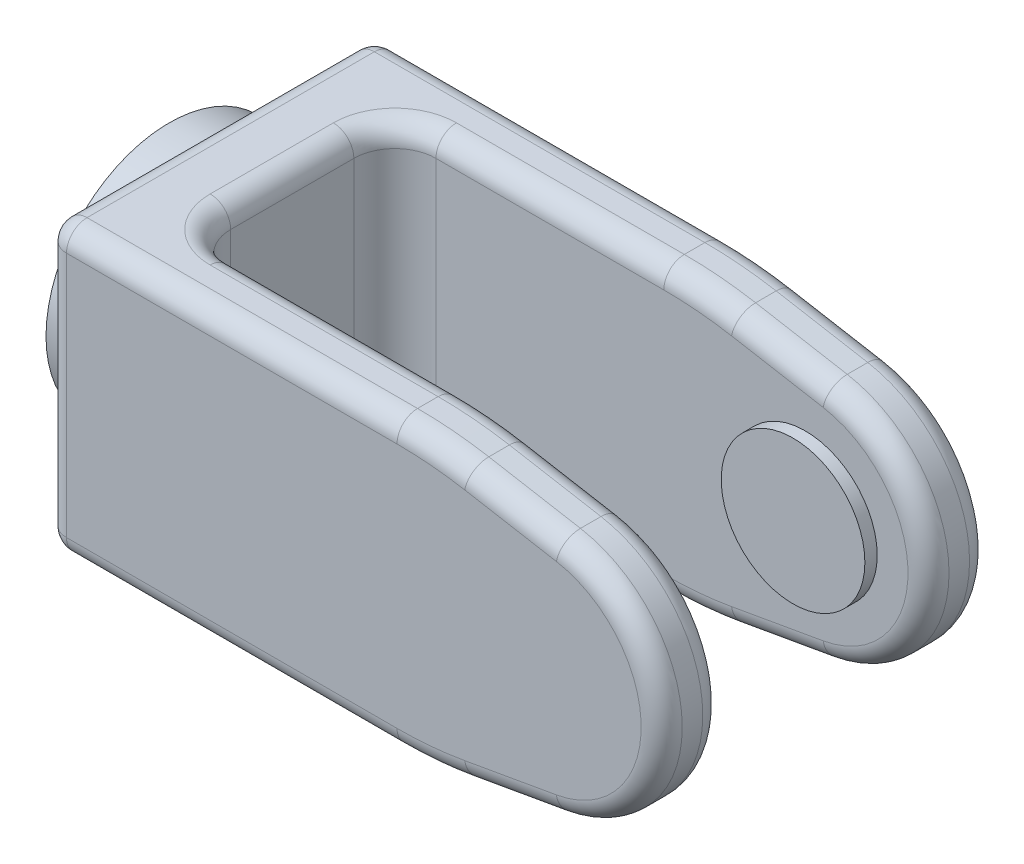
ISO-10303-21;
HEADER;
FILE_DESCRIPTION(('STEP AP214'),'2;1');
FILE_NAME('part.step','',(''),(''),'','','');
FILE_SCHEMA(('AUTOMOTIVE_DESIGN { 1 0 10303 214 1 1 1 1 }'));
ENDSEC;
DATA;
#1=APPLICATION_CONTEXT('core data for automotive mechanical design processes');
#2=APPLICATION_PROTOCOL_DEFINITION('international standard','automotive_design',2000,#1);
#3=PRODUCT_CONTEXT('',#1,'mechanical');
#4=PRODUCT('Part','Part','',(#3));
#5=PRODUCT_RELATED_PRODUCT_CATEGORY('part','',(#4));
#6=PRODUCT_DEFINITION_FORMATION('','',#4);
#7=PRODUCT_DEFINITION_CONTEXT('part definition',#1,'design');
#8=PRODUCT_DEFINITION('design','',#6,#7);
#9=PRODUCT_DEFINITION_SHAPE('','',#8);
#10=(LENGTH_UNIT() NAMED_UNIT(*) SI_UNIT(.MILLI.,.METRE.));
#11=(NAMED_UNIT(*) PLANE_ANGLE_UNIT() SI_UNIT($,.RADIAN.));
#12=(NAMED_UNIT(*) SI_UNIT($,.STERADIAN.) SOLID_ANGLE_UNIT());
#13=UNCERTAINTY_MEASURE_WITH_UNIT(LENGTH_MEASURE(1.E-05),#10,'distance_accuracy_value','');
#14=(GEOMETRIC_REPRESENTATION_CONTEXT(3) GLOBAL_UNCERTAINTY_ASSIGNED_CONTEXT((#13)) GLOBAL_UNIT_ASSIGNED_CONTEXT((#10,
#11,#12)) REPRESENTATION_CONTEXT('',''));
#15=CARTESIAN_POINT('',(0.,0.,0.));
#16=DIRECTION('',(0.,0.,1.));
#17=DIRECTION('',(1.,0.,0.));
#18=AXIS2_PLACEMENT_3D('',#15,#16,#17);
#19=CARTESIAN_POINT('',(0.,70.,40.));
#20=DIRECTION('',(1.,0.,0.));
#21=DIRECTION('',(0.,0.,-1.));
#22=AXIS2_PLACEMENT_3D('',#19,#20,#21);
#23=PLANE('',#22);
#24=CARTESIAN_POINT('',(0.,35.,0.));
#25=DIRECTION('',(-1.,0.,0.));
#26=DIRECTION('',(0.,0.,1.));
#27=AXIS2_PLACEMENT_3D('',#24,#25,#26);
#28=CIRCLE('',#27,30.);
#29=CARTESIAN_POINT('',(0.,65.,0.));
#30=VERTEX_POINT('',#29);
#31=CARTESIAN_POINT('',(0.,5.,0.));
#32=VERTEX_POINT('',#31);
#33=EDGE_CURVE('E656',#30,#32,#28,.T.);
#34=ORIENTED_EDGE('',*,*,#33,.F.);
#35=DIRECTION('',(0.,0.,-1.));
#36=VECTOR('',#35,1.);
#37=CARTESIAN_POINT('',(0.,65.,40.));
#38=LINE('',#37,#36);
#39=CARTESIAN_POINT('',(0.,65.,-35.));
#40=VERTEX_POINT('',#39);
#41=EDGE_CURVE('E508',#30,#40,#38,.T.);
#42=ORIENTED_EDGE('',*,*,#41,.T.);
#43=DIRECTION('',(0.,-1.,0.));
#44=VECTOR('',#43,1.);
#45=CARTESIAN_POINT('',(0.,70.,-35.));
#46=LINE('',#45,#44);
#47=CARTESIAN_POINT('',(0.,5.,-35.));
#48=VERTEX_POINT('',#47);
#49=EDGE_CURVE('E510',#40,#48,#46,.T.);
#50=ORIENTED_EDGE('',*,*,#49,.T.);
#51=DIRECTION('',(0.,0.,-1.));
#52=VECTOR('',#51,1.);
#53=CARTESIAN_POINT('',(0.,5.,40.));
#54=LINE('',#53,#52);
#55=EDGE_CURVE('E512',#48,#32,#54,.F.);
#56=ORIENTED_EDGE('',*,*,#55,.T.);
#57=EDGE_LOOP('',(#34,#42,#50,#56));
#58=FACE_BOUND('',#57,.T.);
#59=ADVANCED_FACE('F36',(#58),#23,.F.);
#60=CARTESIAN_POINT('',(0.,0.,40.));
#61=DIRECTION('',(0.,1.,0.));
#62=DIRECTION('',(0.,0.,1.));
#63=AXIS2_PLACEMENT_3D('',#60,#61,#62);
#64=PLANE('',#63);
#65=CARTESIAN_POINT('',(30.,0.,15.));
#66=DIRECTION('',(0.,1.,0.));
#67=DIRECTION('',(0.,0.,1.));
#68=AXIS2_PLACEMENT_3D('',#65,#66,#67);
#69=CIRCLE('',#68,15.);
#70=CARTESIAN_POINT('',(15.,0.,15.));
#71=VERTEX_POINT('',#70);
#72=CARTESIAN_POINT('',(30.,0.,30.));
#73=VERTEX_POINT('',#72);
#74=EDGE_CURVE('E523',#71,#73,#69,.T.);
#75=ORIENTED_EDGE('',*,*,#74,.T.);
#76=DIRECTION('',(1.,0.,0.));
#77=VECTOR('',#76,1.);
#78=CARTESIAN_POINT('',(85.5193844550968,0.,30.));
#79=LINE('',#78,#77);
#80=CARTESIAN_POINT('',(85.5193844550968,0.,30.));
#81=VERTEX_POINT('',#80);
#82=EDGE_CURVE('E521',#73,#81,#79,.T.);
#83=ORIENTED_EDGE('',*,*,#82,.T.);
#84=DIRECTION('',(0.,0.,-1.));
#85=VECTOR('',#84,1.);
#86=CARTESIAN_POINT('',(85.5193844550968,0.,40.));
#87=LINE('',#86,#85);
#88=CARTESIAN_POINT('',(85.5193844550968,0.,35.));
#89=VERTEX_POINT('',#88);
#90=EDGE_CURVE('E627',#81,#89,#87,.F.);
#91=ORIENTED_EDGE('',*,*,#90,.T.);
#92=DIRECTION('',(1.,0.,0.));
#93=VECTOR('',#92,1.);
#94=CARTESIAN_POINT('',(0.,0.,35.));
#95=LINE('',#94,#93);
#96=CARTESIAN_POINT('',(5.,0.,35.));
#97=VERTEX_POINT('',#96);
#98=EDGE_CURVE('E536',#89,#97,#95,.F.);
#99=ORIENTED_EDGE('',*,*,#98,.T.);
#100=DIRECTION('',(0.,0.,-1.));
#101=VECTOR('',#100,1.);
#102=CARTESIAN_POINT('',(5.,0.,40.));
#103=LINE('',#102,#101);
#104=CARTESIAN_POINT('',(5.,0.,-35.));
#105=VERTEX_POINT('',#104);
#106=EDGE_CURVE('E533',#97,#105,#103,.T.);
#107=ORIENTED_EDGE('',*,*,#106,.T.);
#108=DIRECTION('',(1.,0.,0.));
#109=VECTOR('',#108,1.);
#110=CARTESIAN_POINT('',(0.,0.,-35.));
#111=LINE('',#110,#109);
#112=CARTESIAN_POINT('',(85.5193844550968,0.,-35.));
#113=VERTEX_POINT('',#112);
#114=EDGE_CURVE('E531',#105,#113,#111,.T.);
#115=ORIENTED_EDGE('',*,*,#114,.T.);
#116=DIRECTION('',(0.,0.,-1.));
#117=VECTOR('',#116,1.);
#118=CARTESIAN_POINT('',(85.5193844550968,0.,40.));
#119=LINE('',#118,#117);
#120=CARTESIAN_POINT('',(85.5193844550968,0.,-30.));
#121=VERTEX_POINT('',#120);
#122=EDGE_CURVE('E624',#113,#121,#119,.F.);
#123=ORIENTED_EDGE('',*,*,#122,.T.);
#124=DIRECTION('',(-1.,0.,0.));
#125=VECTOR('',#124,1.);
#126=CARTESIAN_POINT('',(30.,0.,-30.));
#127=LINE('',#126,#125);
#128=CARTESIAN_POINT('',(30.,0.,-30.));
#129=VERTEX_POINT('',#128);
#130=EDGE_CURVE('E529',#121,#129,#127,.T.);
#131=ORIENTED_EDGE('',*,*,#130,.T.);
#132=CARTESIAN_POINT('',(30.,0.,-15.));
#133=DIRECTION('',(0.,1.,0.));
#134=DIRECTION('',(0.,0.,1.));
#135=AXIS2_PLACEMENT_3D('',#132,#133,#134);
#136=CIRCLE('',#135,15.);
#137=CARTESIAN_POINT('',(15.,0.,-15.));
#138=VERTEX_POINT('',#137);
#139=EDGE_CURVE('E527',#129,#138,#136,.T.);
#140=ORIENTED_EDGE('',*,*,#139,.T.);
#141=DIRECTION('',(0.,0.,1.));
#142=VECTOR('',#141,1.);
#143=CARTESIAN_POINT('',(15.,0.,15.));
#144=LINE('',#143,#142);
#145=EDGE_CURVE('E525',#138,#71,#144,.T.);
#146=ORIENTED_EDGE('',*,*,#145,.T.);
#147=EDGE_LOOP('',(#75,#83,#91,#99,#107,#115,#123,#131,#140,#146));
#148=FACE_BOUND('',#147,.T.);
#149=ADVANCED_FACE('F720',(#148),#64,.F.);
#150=CARTESIAN_POINT('',(94.2682508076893,0.,40.));
#151=DIRECTION('',(-0.173648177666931,0.984807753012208,0.));
#152=DIRECTION('',(-0.984807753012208,-0.173648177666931,0.));
#153=AXIS2_PLACEMENT_3D('',#150,#151,#152);
#154=PLANE('',#153);
#155=DIRECTION('',(0.,0.,-1.));
#156=VECTOR('',#155,1.);
#157=CARTESIAN_POINT('',(102.88420222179,1.5192246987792,40.));
#158=LINE('',#157,#156);
#159=CARTESIAN_POINT('',(102.88420222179,1.5192246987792,35.));
#160=VERTEX_POINT('',#159);
#161=CARTESIAN_POINT('',(102.88420222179,1.5192246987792,30.));
#162=VERTEX_POINT('',#161);
#163=EDGE_CURVE('E621',#160,#162,#158,.T.);
#164=ORIENTED_EDGE('',*,*,#163,.T.);
#165=DIRECTION('',(-0.984807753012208,-0.173648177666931,0.));
#166=VECTOR('',#165,1.);
#167=CARTESIAN_POINT('',(125.209445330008,5.45576740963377,30.));
#168=LINE('',#167,#166);
#169=CARTESIAN_POINT('',(125.209445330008,5.45576740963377,30.));
#170=VERTEX_POINT('',#169);
#171=EDGE_CURVE('E550',#162,#170,#168,.F.);
#172=ORIENTED_EDGE('',*,*,#171,.T.);
#173=DIRECTION('',(0.,0.,-1.));
#174=VECTOR('',#173,1.);
#175=CARTESIAN_POINT('',(125.209445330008,5.45576740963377,40.));
#176=LINE('',#175,#174);
#177=CARTESIAN_POINT('',(125.209445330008,5.45576740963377,35.));
#178=VERTEX_POINT('',#177);
#179=EDGE_CURVE('E638',#178,#170,#176,.T.);
#180=ORIENTED_EDGE('',*,*,#179,.F.);
#181=DIRECTION('',(0.984807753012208,0.173648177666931,0.));
#182=VECTOR('',#181,1.);
#183=CARTESIAN_POINT('',(102.88420222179,1.5192246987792,35.));
#184=LINE('',#183,#182);
#185=EDGE_CURVE('E552',#178,#160,#184,.F.);
#186=ORIENTED_EDGE('',*,*,#185,.T.);
#187=EDGE_LOOP('',(#164,#172,#180,#186));
#188=FACE_BOUND('',#187,.T.);
#189=ADVANCED_FACE('F756',(#188),#154,.F.);
#190=CARTESIAN_POINT('',(125.209445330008,5.45576740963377,-30.));
#191=VERTEX_POINT('',#190);
#192=CARTESIAN_POINT('',(125.209445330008,5.45576740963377,-35.));
#193=VERTEX_POINT('',#192);
#194=EDGE_CURVE('E641',#191,#193,#176,.T.);
#195=ORIENTED_EDGE('',*,*,#194,.F.);
#196=DIRECTION('',(0.984807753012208,0.173648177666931,0.));
#197=VECTOR('',#196,1.);
#198=CARTESIAN_POINT('',(102.88420222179,1.5192246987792,-30.));
#199=LINE('',#198,#197);
#200=CARTESIAN_POINT('',(102.88420222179,1.5192246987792,-30.));
#201=VERTEX_POINT('',#200);
#202=EDGE_CURVE('E576',#191,#201,#199,.F.);
#203=ORIENTED_EDGE('',*,*,#202,.T.);
#204=DIRECTION('',(0.,0.,-1.));
#205=VECTOR('',#204,1.);
#206=CARTESIAN_POINT('',(102.88420222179,1.5192246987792,40.));
#207=LINE('',#206,#205);
#208=CARTESIAN_POINT('',(102.88420222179,1.5192246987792,-35.));
#209=VERTEX_POINT('',#208);
#210=EDGE_CURVE('E630',#201,#209,#207,.T.);
#211=ORIENTED_EDGE('',*,*,#210,.T.);
#212=DIRECTION('',(0.984807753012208,0.173648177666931,0.));
#213=VECTOR('',#212,1.);
#214=CARTESIAN_POINT('',(94.2682508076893,0.,-35.));
#215=LINE('',#214,#213);
#216=EDGE_CURVE('E578',#209,#193,#215,.T.);
#217=ORIENTED_EDGE('',*,*,#216,.T.);
#218=EDGE_LOOP('',(#195,#203,#211,#217));
#219=FACE_BOUND('',#218,.T.);
#220=ADVANCED_FACE('F1006',(#219),#154,.F.);
#221=CARTESIAN_POINT('',(120.,35.,40.));
#222=DIRECTION('',(0.,0.,-1.));
#223=DIRECTION('',(-1.,0.,0.));
#224=AXIS2_PLACEMENT_3D('',#221,#222,#223);
#225=CYLINDRICAL_SURFACE('',#224,30.);
#226=ORIENTED_EDGE('',*,*,#179,.T.);
#227=CARTESIAN_POINT('',(120.,35.,30.));
#228=DIRECTION('',(0.,0.,-1.));
#229=DIRECTION('',(-1.,0.,0.));
#230=AXIS2_PLACEMENT_3D('',#227,#228,#229);
#231=CIRCLE('',#230,30.);
#232=CARTESIAN_POINT('',(125.209445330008,64.5442325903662,30.));
#233=VERTEX_POINT('',#232);
#234=EDGE_CURVE('E546',#170,#233,#231,.F.);
#235=ORIENTED_EDGE('',*,*,#234,.T.);
#236=DIRECTION('',(0.,0.,-1.));
#237=VECTOR('',#236,1.);
#238=CARTESIAN_POINT('',(125.209445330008,64.5442325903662,40.));
#239=LINE('',#238,#237);
#240=CARTESIAN_POINT('',(125.209445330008,64.5442325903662,35.));
#241=VERTEX_POINT('',#240);
#242=EDGE_CURVE('E642',#241,#233,#239,.T.);
#243=ORIENTED_EDGE('',*,*,#242,.F.);
#244=CARTESIAN_POINT('',(120.,35.,35.));
#245=DIRECTION('',(0.,0.,1.));
#246=DIRECTION('',(1.,0.,0.));
#247=AXIS2_PLACEMENT_3D('',#244,#245,#246);
#248=CIRCLE('',#247,30.);
#249=EDGE_CURVE('E548',#241,#178,#248,.F.);
#250=ORIENTED_EDGE('',*,*,#249,.T.);
#251=EDGE_LOOP('',(#226,#235,#243,#250));
#252=FACE_BOUND('',#251,.T.);
#253=ADVANCED_FACE('F1008',(#252),#225,.T.);
#254=CARTESIAN_POINT('',(125.209445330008,64.5442325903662,-30.));
#255=VERTEX_POINT('',#254);
#256=CARTESIAN_POINT('',(125.209445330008,64.5442325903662,-35.));
#257=VERTEX_POINT('',#256);
#258=EDGE_CURVE('E645',#255,#257,#239,.T.);
#259=ORIENTED_EDGE('',*,*,#258,.F.);
#260=CARTESIAN_POINT('',(120.,35.,-30.));
#261=DIRECTION('',(0.,0.,1.));
#262=DIRECTION('',(1.,0.,0.));
#263=AXIS2_PLACEMENT_3D('',#260,#261,#262);
#264=CIRCLE('',#263,30.);
#265=EDGE_CURVE('E580',#255,#191,#264,.F.);
#266=ORIENTED_EDGE('',*,*,#265,.T.);
#267=ORIENTED_EDGE('',*,*,#194,.T.);
#268=CARTESIAN_POINT('',(120.,35.,-35.));
#269=DIRECTION('',(0.,0.,1.));
#270=DIRECTION('',(1.,0.,0.));
#271=AXIS2_PLACEMENT_3D('',#268,#269,#270);
#272=CIRCLE('',#271,30.);
#273=EDGE_CURVE('E582',#193,#257,#272,.T.);
#274=ORIENTED_EDGE('',*,*,#273,.T.);
#275=EDGE_LOOP('',(#259,#266,#267,#274));
#276=FACE_BOUND('',#275,.T.);
#277=ADVANCED_FACE('F993',(#276),#225,.T.);
#278=CARTESIAN_POINT('',(125.209445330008,64.5442325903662,40.));
#279=DIRECTION('',(-0.173648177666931,-0.984807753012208,0.));
#280=DIRECTION('',(0.984807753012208,-0.173648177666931,0.));
#281=AXIS2_PLACEMENT_3D('',#278,#279,#280);
#282=PLANE('',#281);
#283=ORIENTED_EDGE('',*,*,#242,.T.);
#284=DIRECTION('',(0.984807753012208,-0.173648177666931,0.));
#285=VECTOR('',#284,1.);
#286=CARTESIAN_POINT('',(102.88420222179,68.4807753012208,30.));
#287=LINE('',#286,#285);
#288=CARTESIAN_POINT('',(102.88420222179,68.4807753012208,30.));
#289=VERTEX_POINT('',#288);
#290=EDGE_CURVE('E542',#233,#289,#287,.F.);
#291=ORIENTED_EDGE('',*,*,#290,.T.);
#292=DIRECTION('',(0.,0.,-1.));
#293=VECTOR('',#292,1.);
#294=CARTESIAN_POINT('',(102.88420222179,68.4807753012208,40.));
#295=LINE('',#294,#293);
#296=CARTESIAN_POINT('',(102.88420222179,68.4807753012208,35.));
#297=VERTEX_POINT('',#296);
#298=EDGE_CURVE('E309',#289,#297,#295,.F.);
#299=ORIENTED_EDGE('',*,*,#298,.T.);
#300=DIRECTION('',(-0.984807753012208,0.173648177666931,0.));
#301=VECTOR('',#300,1.);
#302=CARTESIAN_POINT('',(125.209445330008,64.5442325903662,35.));
#303=LINE('',#302,#301);
#304=EDGE_CURVE('E544',#297,#241,#303,.F.);
#305=ORIENTED_EDGE('',*,*,#304,.T.);
#306=EDGE_LOOP('',(#283,#291,#299,#305));
#307=FACE_BOUND('',#306,.T.);
#308=ADVANCED_FACE('F1017',(#307),#282,.F.);
#309=DIRECTION('',(0.,0.,-1.));
#310=VECTOR('',#309,1.);
#311=CARTESIAN_POINT('',(102.88420222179,68.4807753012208,40.));
#312=LINE('',#311,#310);
#313=CARTESIAN_POINT('',(102.88420222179,68.4807753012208,-35.));
#314=VERTEX_POINT('',#313);
#315=CARTESIAN_POINT('',(102.88420222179,68.4807753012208,-30.));
#316=VERTEX_POINT('',#315);
#317=EDGE_CURVE('E612',#314,#316,#312,.F.);
#318=ORIENTED_EDGE('',*,*,#317,.T.);
#319=DIRECTION('',(-0.984807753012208,0.173648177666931,0.));
#320=VECTOR('',#319,1.);
#321=CARTESIAN_POINT('',(125.209445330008,64.5442325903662,-30.));
#322=LINE('',#321,#320);
#323=EDGE_CURVE('E584',#316,#255,#322,.F.);
#324=ORIENTED_EDGE('',*,*,#323,.T.);
#325=ORIENTED_EDGE('',*,*,#258,.T.);
#326=DIRECTION('',(-0.984807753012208,0.173648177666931,0.));
#327=VECTOR('',#326,1.);
#328=CARTESIAN_POINT('',(125.209445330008,64.5442325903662,-35.));
#329=LINE('',#328,#327);
#330=EDGE_CURVE('E586',#257,#314,#329,.T.);
#331=ORIENTED_EDGE('',*,*,#330,.T.);
#332=EDGE_LOOP('',(#318,#324,#325,#331));
#333=FACE_BOUND('',#332,.T.);
#334=ADVANCED_FACE('F989',(#333),#282,.F.);
#335=CARTESIAN_POINT('',(94.2682508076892,70.,40.));
#336=DIRECTION('',(0.,-1.,0.));
#337=DIRECTION('',(0.,0.,-1.));
#338=AXIS2_PLACEMENT_3D('',#335,#336,#337);
#339=PLANE('',#338);
#340=DIRECTION('',(0.,0.,-1.));
#341=VECTOR('',#340,1.);
#342=CARTESIAN_POINT('',(85.5193844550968,70.,40.));
#343=LINE('',#342,#341);
#344=CARTESIAN_POINT('',(85.5193844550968,70.,35.));
#345=VERTEX_POINT('',#344);
#346=CARTESIAN_POINT('',(85.5193844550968,70.,30.));
#347=VERTEX_POINT('',#346);
#348=EDGE_CURVE('E618',#345,#347,#343,.T.);
#349=ORIENTED_EDGE('',*,*,#348,.T.);
#350=DIRECTION('',(1.,0.,0.));
#351=VECTOR('',#350,1.);
#352=CARTESIAN_POINT('',(30.,70.,30.));
#353=LINE('',#352,#351);
#354=CARTESIAN_POINT('',(30.,70.,30.));
#355=VERTEX_POINT('',#354);
#356=EDGE_CURVE('E485',#347,#355,#353,.F.);
#357=ORIENTED_EDGE('',*,*,#356,.T.);
#358=CARTESIAN_POINT('',(30.,70.,15.));
#359=DIRECTION('',(0.,-1.,0.));
#360=DIRECTION('',(0.,0.,-1.));
#361=AXIS2_PLACEMENT_3D('',#358,#359,#360);
#362=CIRCLE('',#361,15.);
#363=CARTESIAN_POINT('',(15.,70.,15.));
#364=VERTEX_POINT('',#363);
#365=EDGE_CURVE('E487',#355,#364,#362,.T.);
#366=ORIENTED_EDGE('',*,*,#365,.T.);
#367=DIRECTION('',(0.,0.,1.));
#368=VECTOR('',#367,1.);
#369=CARTESIAN_POINT('',(15.,70.,-15.));
#370=LINE('',#369,#368);
#371=CARTESIAN_POINT('',(15.,70.,-15.));
#372=VERTEX_POINT('',#371);
#373=EDGE_CURVE('E489',#364,#372,#370,.F.);
#374=ORIENTED_EDGE('',*,*,#373,.T.);
#375=CARTESIAN_POINT('',(30.,70.,-15.));
#376=DIRECTION('',(0.,-1.,0.));
#377=DIRECTION('',(0.,0.,-1.));
#378=AXIS2_PLACEMENT_3D('',#375,#376,#377);
#379=CIRCLE('',#378,15.);
#380=CARTESIAN_POINT('',(30.,70.,-30.));
#381=VERTEX_POINT('',#380);
#382=EDGE_CURVE('E491',#372,#381,#379,.T.);
#383=ORIENTED_EDGE('',*,*,#382,.T.);
#384=DIRECTION('',(-1.,0.,0.));
#385=VECTOR('',#384,1.);
#386=CARTESIAN_POINT('',(85.5193844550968,70.,-30.));
#387=LINE('',#386,#385);
#388=CARTESIAN_POINT('',(85.5193844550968,70.,-30.));
#389=VERTEX_POINT('',#388);
#390=EDGE_CURVE('E323',#381,#389,#387,.F.);
#391=ORIENTED_EDGE('',*,*,#390,.T.);
#392=DIRECTION('',(0.,0.,-1.));
#393=VECTOR('',#392,1.);
#394=CARTESIAN_POINT('',(85.5193844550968,70.,40.));
#395=LINE('',#394,#393);
#396=CARTESIAN_POINT('',(85.5193844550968,70.,-35.));
#397=VERTEX_POINT('',#396);
#398=EDGE_CURVE('E615',#389,#397,#395,.T.);
#399=ORIENTED_EDGE('',*,*,#398,.T.);
#400=DIRECTION('',(-1.,0.,0.));
#401=VECTOR('',#400,1.);
#402=CARTESIAN_POINT('',(94.2682508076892,70.,-35.));
#403=LINE('',#402,#401);
#404=CARTESIAN_POINT('',(5.,70.,-35.));
#405=VERTEX_POINT('',#404);
#406=EDGE_CURVE('E494',#397,#405,#403,.T.);
#407=ORIENTED_EDGE('',*,*,#406,.T.);
#408=DIRECTION('',(0.,0.,-1.));
#409=VECTOR('',#408,1.);
#410=CARTESIAN_POINT('',(5.,70.,40.));
#411=LINE('',#410,#409);
#412=CARTESIAN_POINT('',(5.,70.,35.));
#413=VERTEX_POINT('',#412);
#414=EDGE_CURVE('E496',#405,#413,#411,.F.);
#415=ORIENTED_EDGE('',*,*,#414,.T.);
#416=DIRECTION('',(-1.,0.,0.));
#417=VECTOR('',#416,1.);
#418=CARTESIAN_POINT('',(85.5193844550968,70.,35.));
#419=LINE('',#418,#417);
#420=EDGE_CURVE('E498',#413,#345,#419,.F.);
#421=ORIENTED_EDGE('',*,*,#420,.T.);
#422=EDGE_LOOP('',(#349,#357,#366,#374,#383,#391,#399,#407,#415,#421));
#423=FACE_BOUND('',#422,.T.);
#424=ADVANCED_FACE('F748',(#423),#339,.F.);
#425=EDGE_CURVE('E637',#32,#30,#28,.T.);
#426=ORIENTED_EDGE('',*,*,#425,.F.);
#427=DIRECTION('',(0.,0.,-1.));
#428=VECTOR('',#427,1.);
#429=CARTESIAN_POINT('',(0.,5.,40.));
#430=LINE('',#429,#428);
#431=CARTESIAN_POINT('',(0.,5.,35.));
#432=VERTEX_POINT('',#431);
#433=EDGE_CURVE('E515',#32,#432,#430,.F.);
#434=ORIENTED_EDGE('',*,*,#433,.T.);
#435=DIRECTION('',(0.,-1.,0.));
#436=VECTOR('',#435,1.);
#437=CARTESIAN_POINT('',(0.,70.,35.));
#438=LINE('',#437,#436);
#439=CARTESIAN_POINT('',(0.,65.,35.));
#440=VERTEX_POINT('',#439);
#441=EDGE_CURVE('E519',#432,#440,#438,.F.);
#442=ORIENTED_EDGE('',*,*,#441,.T.);
#443=DIRECTION('',(0.,0.,-1.));
#444=VECTOR('',#443,1.);
#445=CARTESIAN_POINT('',(0.,65.,40.));
#446=LINE('',#445,#444);
#447=EDGE_CURVE('E517',#440,#30,#446,.T.);
#448=ORIENTED_EDGE('',*,*,#447,.T.);
#449=EDGE_LOOP('',(#426,#434,#442,#448));
#450=FACE_BOUND('',#449,.T.);
#451=ADVANCED_FACE('F739',(#450),#23,.F.);
#452=CARTESIAN_POINT('',(120.,35.,40.));
#453=DIRECTION('',(0.,0.,1.));
#454=DIRECTION('',(1.,0.,0.));
#455=AXIS2_PLACEMENT_3D('',#452,#453,#454);
#456=PLANE('',#455);
#457=DIRECTION('',(-1.,0.,0.));
#458=VECTOR('',#457,1.);
#459=CARTESIAN_POINT('',(0.,65.,40.));
#460=LINE('',#459,#458);
#461=CARTESIAN_POINT('',(85.5193844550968,65.,40.));
#462=VERTEX_POINT('',#461);
#463=CARTESIAN_POINT('',(5.,65.,40.));
#464=VERTEX_POINT('',#463);
#465=EDGE_CURVE('E45',#462,#464,#460,.T.);
#466=ORIENTED_EDGE('',*,*,#465,.T.);
#467=DIRECTION('',(0.,-1.,0.));
#468=VECTOR('',#467,1.);
#469=CARTESIAN_POINT('',(5.,0.,40.));
#470=LINE('',#469,#468);
#471=CARTESIAN_POINT('',(5.,5.,40.));
#472=VERTEX_POINT('',#471);
#473=EDGE_CURVE('E11',#464,#472,#470,.T.);
#474=ORIENTED_EDGE('',*,*,#473,.T.);
#475=DIRECTION('',(1.,0.,0.));
#476=VECTOR('',#475,1.);
#477=CARTESIAN_POINT('',(85.5193844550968,5.,40.));
#478=LINE('',#477,#476);
#479=CARTESIAN_POINT('',(85.5193844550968,5.,40.));
#480=VERTEX_POINT('',#479);
#481=EDGE_CURVE('E466',#472,#480,#478,.T.);
#482=ORIENTED_EDGE('',*,*,#481,.T.);
#483=CARTESIAN_POINT('',(85.5193844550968,100.,40.));
#484=DIRECTION('',(0.,0.,1.));
#485=DIRECTION('',(1.,0.,0.));
#486=AXIS2_PLACEMENT_3D('',#483,#484,#485);
#487=CIRCLE('',#486,95.);
#488=CARTESIAN_POINT('',(102.015961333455,6.44326346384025,40.));
#489=VERTEX_POINT('',#488);
#490=EDGE_CURVE('E464',#480,#489,#487,.T.);
#491=ORIENTED_EDGE('',*,*,#490,.T.);
#492=DIRECTION('',(0.984807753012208,0.173648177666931,0.));
#493=VECTOR('',#492,1.);
#494=CARTESIAN_POINT('',(124.341204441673,10.3798061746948,40.));
#495=LINE('',#494,#493);
#496=CARTESIAN_POINT('',(124.341204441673,10.3798061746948,40.));
#497=VERTEX_POINT('',#496);
#498=EDGE_CURVE('E462',#489,#497,#495,.T.);
#499=ORIENTED_EDGE('',*,*,#498,.T.);
#500=CARTESIAN_POINT('',(120.,35.,40.));
#501=DIRECTION('',(0.,0.,1.));
#502=DIRECTION('',(1.,0.,0.));
#503=AXIS2_PLACEMENT_3D('',#500,#501,#502);
#504=CIRCLE('',#503,25.);
#505=CARTESIAN_POINT('',(124.341204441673,59.6201938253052,40.));
#506=VERTEX_POINT('',#505);
#507=EDGE_CURVE('E460',#497,#506,#504,.T.);
#508=ORIENTED_EDGE('',*,*,#507,.T.);
#509=DIRECTION('',(-0.984807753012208,0.173648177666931,0.));
#510=VECTOR('',#509,1.);
#511=CARTESIAN_POINT('',(102.015961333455,63.5567365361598,40.));
#512=LINE('',#511,#510);
#513=CARTESIAN_POINT('',(102.015961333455,63.5567365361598,40.));
#514=VERTEX_POINT('',#513);
#515=EDGE_CURVE('E458',#506,#514,#512,.T.);
#516=ORIENTED_EDGE('',*,*,#515,.T.);
#517=CARTESIAN_POINT('',(85.5193844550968,-30.,40.));
#518=DIRECTION('',(0.,0.,1.));
#519=DIRECTION('',(1.,0.,0.));
#520=AXIS2_PLACEMENT_3D('',#517,#518,#519);
#521=CIRCLE('',#520,95.);
#522=EDGE_CURVE('E56',#514,#462,#521,.T.);
#523=ORIENTED_EDGE('',*,*,#522,.T.);
#524=EDGE_LOOP('',(#466,#474,#482,#491,#499,#508,#516,#523));
#525=FACE_BOUND('',#524,.T.);
#526=ADVANCED_FACE('F736',(#525),#456,.T.);
#527=CARTESIAN_POINT('',(120.,35.,-40.));
#528=DIRECTION('',(0.,0.,1.));
#529=DIRECTION('',(1.,0.,0.));
#530=AXIS2_PLACEMENT_3D('',#527,#528,#529);
#531=PLANE('',#530);
#532=DIRECTION('',(-0.984807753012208,0.173648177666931,0.));
#533=VECTOR('',#532,1.);
#534=CARTESIAN_POINT('',(124.341204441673,59.6201938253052,-40.));
#535=LINE('',#534,#533);
#536=CARTESIAN_POINT('',(102.015961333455,63.5567365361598,-40.));
#537=VERTEX_POINT('',#536);
#538=CARTESIAN_POINT('',(124.341204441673,59.6201938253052,-40.));
#539=VERTEX_POINT('',#538);
#540=EDGE_CURVE('E471',#537,#539,#535,.F.);
#541=ORIENTED_EDGE('',*,*,#540,.T.);
#542=CARTESIAN_POINT('',(120.,35.,-40.));
#543=DIRECTION('',(0.,0.,1.));
#544=DIRECTION('',(1.,0.,0.));
#545=AXIS2_PLACEMENT_3D('',#542,#543,#544);
#546=CIRCLE('',#545,25.);
#547=CARTESIAN_POINT('',(124.341204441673,10.3798061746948,-40.));
#548=VERTEX_POINT('',#547);
#549=EDGE_CURVE('E468',#539,#548,#546,.F.);
#550=ORIENTED_EDGE('',*,*,#549,.T.);
#551=DIRECTION('',(0.984807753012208,0.173648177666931,0.));
#552=VECTOR('',#551,1.);
#553=CARTESIAN_POINT('',(124.341204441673,10.3798061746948,-40.));
#554=LINE('',#553,#552);
#555=CARTESIAN_POINT('',(102.015961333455,6.44326346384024,-40.));
#556=VERTEX_POINT('',#555);
#557=EDGE_CURVE('E483',#548,#556,#554,.F.);
#558=ORIENTED_EDGE('',*,*,#557,.T.);
#559=CARTESIAN_POINT('',(85.5193844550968,100.,-40.));
#560=DIRECTION('',(0.,0.,1.));
#561=DIRECTION('',(1.,0.,0.));
#562=AXIS2_PLACEMENT_3D('',#559,#560,#561);
#563=CIRCLE('',#562,95.);
#564=CARTESIAN_POINT('',(85.5193844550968,5.,-40.));
#565=VERTEX_POINT('',#564);
#566=EDGE_CURVE('E481',#556,#565,#563,.F.);
#567=ORIENTED_EDGE('',*,*,#566,.T.);
#568=DIRECTION('',(1.,0.,0.));
#569=VECTOR('',#568,1.);
#570=CARTESIAN_POINT('',(120.,5.,-40.));
#571=LINE('',#570,#569);
#572=CARTESIAN_POINT('',(5.,5.,-40.));
#573=VERTEX_POINT('',#572);
#574=EDGE_CURVE('E479',#565,#573,#571,.F.);
#575=ORIENTED_EDGE('',*,*,#574,.T.);
#576=DIRECTION('',(0.,-1.,0.));
#577=VECTOR('',#576,1.);
#578=CARTESIAN_POINT('',(5.,35.,-40.));
#579=LINE('',#578,#577);
#580=CARTESIAN_POINT('',(5.,65.,-40.));
#581=VERTEX_POINT('',#580);
#582=EDGE_CURVE('E477',#573,#581,#579,.F.);
#583=ORIENTED_EDGE('',*,*,#582,.T.);
#584=DIRECTION('',(-1.,0.,0.));
#585=VECTOR('',#584,1.);
#586=CARTESIAN_POINT('',(120.,65.,-40.));
#587=LINE('',#586,#585);
#588=CARTESIAN_POINT('',(85.5193844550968,65.,-40.));
#589=VERTEX_POINT('',#588);
#590=EDGE_CURVE('E475',#581,#589,#587,.F.);
#591=ORIENTED_EDGE('',*,*,#590,.T.);
#592=CARTESIAN_POINT('',(85.5193844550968,-30.,-40.));
#593=DIRECTION('',(0.,0.,1.));
#594=DIRECTION('',(1.,0.,0.));
#595=AXIS2_PLACEMENT_3D('',#592,#593,#594);
#596=CIRCLE('',#595,95.);
#597=EDGE_CURVE('E473',#589,#537,#596,.F.);
#598=ORIENTED_EDGE('',*,*,#597,.T.);
#599=EDGE_LOOP('',(#541,#550,#558,#567,#575,#583,#591,#598));
#600=FACE_BOUND('',#599,.T.);
#601=ADVANCED_FACE('F738',(#600),#531,.F.);
#602=CARTESIAN_POINT('',(20.,70.,25.));
#603=DIRECTION('',(0.,0.,-1.));
#604=DIRECTION('',(-1.,0.,0.));
#605=AXIS2_PLACEMENT_3D('',#602,#603,#604);
#606=PLANE('',#605);
#607=CARTESIAN_POINT('',(120.,35.,25.));
#608=DIRECTION('',(0.,0.,-1.));
#609=DIRECTION('',(-1.,0.,0.));
#610=AXIS2_PLACEMENT_3D('',#607,#608,#609);
#611=CIRCLE('',#610,17.5);
#612=CARTESIAN_POINT('',(102.5,35.,25.));
#613=VERTEX_POINT('',#612);
#614=EDGE_CURVE('E634',#613,#613,#611,.T.);
#615=ORIENTED_EDGE('',*,*,#614,.F.);
#616=EDGE_LOOP('',(#615));
#617=FACE_BOUND('',#616,.T.);
#618=CARTESIAN_POINT('',(85.5193844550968,100.,25.));
#619=DIRECTION('',(0.,0.,-1.));
#620=DIRECTION('',(-1.,0.,0.));
#621=AXIS2_PLACEMENT_3D('',#618,#619,#620);
#622=CIRCLE('',#621,95.);
#623=CARTESIAN_POINT('',(102.015961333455,6.44326346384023,25.));
#624=VERTEX_POINT('',#623);
#625=CARTESIAN_POINT('',(85.5193844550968,5.,25.));
#626=VERTEX_POINT('',#625);
#627=EDGE_CURVE('E560',#624,#626,#622,.T.);
#628=ORIENTED_EDGE('',*,*,#627,.T.);
#629=DIRECTION('',(1.,0.,0.));
#630=VECTOR('',#629,1.);
#631=CARTESIAN_POINT('',(30.,5.,25.));
#632=LINE('',#631,#630);
#633=CARTESIAN_POINT('',(30.,5.,25.));
#634=VERTEX_POINT('',#633);
#635=EDGE_CURVE('E558',#626,#634,#632,.F.);
#636=ORIENTED_EDGE('',*,*,#635,.T.);
#637=DIRECTION('',(0.,-1.,0.));
#638=VECTOR('',#637,1.);
#639=CARTESIAN_POINT('',(30.,70.,25.));
#640=LINE('',#639,#638);
#641=CARTESIAN_POINT('',(30.,65.,25.));
#642=VERTEX_POINT('',#641);
#643=EDGE_CURVE('E298',#634,#642,#640,.F.);
#644=ORIENTED_EDGE('',*,*,#643,.T.);
#645=DIRECTION('',(1.,0.,0.));
#646=VECTOR('',#645,1.);
#647=CARTESIAN_POINT('',(85.5193844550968,65.,25.));
#648=LINE('',#647,#646);
#649=CARTESIAN_POINT('',(85.5193844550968,65.,25.));
#650=VERTEX_POINT('',#649);
#651=EDGE_CURVE('E570',#642,#650,#648,.T.);
#652=ORIENTED_EDGE('',*,*,#651,.T.);
#653=CARTESIAN_POINT('',(85.5193844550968,-30.,25.));
#654=DIRECTION('',(0.,0.,-1.));
#655=DIRECTION('',(-1.,0.,0.));
#656=AXIS2_PLACEMENT_3D('',#653,#654,#655);
#657=CIRCLE('',#656,95.);
#658=CARTESIAN_POINT('',(102.015961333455,63.5567365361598,25.));
#659=VERTEX_POINT('',#658);
#660=EDGE_CURVE('E568',#650,#659,#657,.T.);
#661=ORIENTED_EDGE('',*,*,#660,.T.);
#662=DIRECTION('',(0.984807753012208,-0.173648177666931,0.));
#663=VECTOR('',#662,1.);
#664=CARTESIAN_POINT('',(124.341204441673,59.6201938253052,25.));
#665=LINE('',#664,#663);
#666=CARTESIAN_POINT('',(124.341204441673,59.6201938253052,25.));
#667=VERTEX_POINT('',#666);
#668=EDGE_CURVE('E566',#659,#667,#665,.T.);
#669=ORIENTED_EDGE('',*,*,#668,.T.);
#670=CARTESIAN_POINT('',(120.,35.,25.));
#671=DIRECTION('',(0.,0.,-1.));
#672=DIRECTION('',(-1.,0.,0.));
#673=AXIS2_PLACEMENT_3D('',#670,#671,#672);
#674=CIRCLE('',#673,25.);
#675=CARTESIAN_POINT('',(124.341204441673,10.3798061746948,25.));
#676=VERTEX_POINT('',#675);
#677=EDGE_CURVE('E564',#667,#676,#674,.T.);
#678=ORIENTED_EDGE('',*,*,#677,.T.);
#679=DIRECTION('',(-0.984807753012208,-0.173648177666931,0.));
#680=VECTOR('',#679,1.);
#681=CARTESIAN_POINT('',(102.015961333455,6.44326346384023,25.));
#682=LINE('',#681,#680);
#683=EDGE_CURVE('E562',#676,#624,#682,.T.);
#684=ORIENTED_EDGE('',*,*,#683,.T.);
#685=EDGE_LOOP('',(#628,#636,#644,#652,#661,#669,#678,#684));
#686=FACE_BOUND('',#685,.T.);
#687=ADVANCED_FACE('F745',(#617,#686),#606,.T.);
#688=CARTESIAN_POINT('',(20.,70.,-25.));
#689=DIRECTION('',(0.,0.,1.));
#690=DIRECTION('',(1.,0.,0.));
#691=AXIS2_PLACEMENT_3D('',#688,#689,#690);
#692=PLANE('',#691);
#693=CARTESIAN_POINT('',(120.,35.,-25.));
#694=DIRECTION('',(0.,0.,1.));
#695=DIRECTION('',(1.,0.,0.));
#696=AXIS2_PLACEMENT_3D('',#693,#694,#695);
#697=CIRCLE('',#696,17.5);
#698=CARTESIAN_POINT('',(137.5,35.,-25.));
#699=VERTEX_POINT('',#698);
#700=EDGE_CURVE('E646',#699,#699,#697,.T.);
#701=ORIENTED_EDGE('',*,*,#700,.F.);
#702=EDGE_LOOP('',(#701));
#703=FACE_BOUND('',#702,.T.);
#704=DIRECTION('',(0.,-1.,0.));
#705=VECTOR('',#704,1.);
#706=CARTESIAN_POINT('',(30.,0.,-25.));
#707=LINE('',#706,#705);
#708=CARTESIAN_POINT('',(30.,65.,-25.));
#709=VERTEX_POINT('',#708);
#710=CARTESIAN_POINT('',(30.,5.,-25.));
#711=VERTEX_POINT('',#710);
#712=EDGE_CURVE('E291',#709,#711,#707,.T.);
#713=ORIENTED_EDGE('',*,*,#712,.T.);
#714=DIRECTION('',(-1.,0.,0.));
#715=VECTOR('',#714,1.);
#716=CARTESIAN_POINT('',(85.5193844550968,5.,-25.));
#717=LINE('',#716,#715);
#718=CARTESIAN_POINT('',(85.5193844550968,5.,-25.));
#719=VERTEX_POINT('',#718);
#720=EDGE_CURVE('E593',#711,#719,#717,.F.);
#721=ORIENTED_EDGE('',*,*,#720,.T.);
#722=CARTESIAN_POINT('',(85.5193844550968,100.,-25.));
#723=DIRECTION('',(0.,0.,1.));
#724=DIRECTION('',(1.,0.,0.));
#725=AXIS2_PLACEMENT_3D('',#722,#723,#724);
#726=CIRCLE('',#725,95.);
#727=CARTESIAN_POINT('',(102.015961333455,6.44326346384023,-25.));
#728=VERTEX_POINT('',#727);
#729=EDGE_CURVE('E595',#719,#728,#726,.T.);
#730=ORIENTED_EDGE('',*,*,#729,.T.);
#731=DIRECTION('',(0.984807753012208,0.173648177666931,0.));
#732=VECTOR('',#731,1.);
#733=CARTESIAN_POINT('',(124.341204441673,10.3798061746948,-25.));
#734=LINE('',#733,#732);
#735=CARTESIAN_POINT('',(124.341204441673,10.3798061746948,-25.));
#736=VERTEX_POINT('',#735);
#737=EDGE_CURVE('E597',#728,#736,#734,.T.);
#738=ORIENTED_EDGE('',*,*,#737,.T.);
#739=CARTESIAN_POINT('',(120.,35.,-25.));
#740=DIRECTION('',(0.,0.,1.));
#741=DIRECTION('',(1.,0.,0.));
#742=AXIS2_PLACEMENT_3D('',#739,#740,#741);
#743=CIRCLE('',#742,25.);
#744=CARTESIAN_POINT('',(124.341204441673,59.6201938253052,-25.));
#745=VERTEX_POINT('',#744);
#746=EDGE_CURVE('E599',#736,#745,#743,.T.);
#747=ORIENTED_EDGE('',*,*,#746,.T.);
#748=DIRECTION('',(-0.984807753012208,0.173648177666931,0.));
#749=VECTOR('',#748,1.);
#750=CARTESIAN_POINT('',(102.015961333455,63.5567365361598,-25.));
#751=LINE('',#750,#749);
#752=CARTESIAN_POINT('',(102.015961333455,63.5567365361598,-25.));
#753=VERTEX_POINT('',#752);
#754=EDGE_CURVE('E601',#745,#753,#751,.T.);
#755=ORIENTED_EDGE('',*,*,#754,.T.);
#756=CARTESIAN_POINT('',(85.5193844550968,-30.,-25.));
#757=DIRECTION('',(0.,0.,1.));
#758=DIRECTION('',(1.,0.,0.));
#759=AXIS2_PLACEMENT_3D('',#756,#757,#758);
#760=CIRCLE('',#759,95.);
#761=CARTESIAN_POINT('',(85.5193844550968,65.,-25.));
#762=VERTEX_POINT('',#761);
#763=EDGE_CURVE('E294',#753,#762,#760,.T.);
#764=ORIENTED_EDGE('',*,*,#763,.T.);
#765=DIRECTION('',(-1.,0.,0.));
#766=VECTOR('',#765,1.);
#767=CARTESIAN_POINT('',(30.,65.,-25.));
#768=LINE('',#767,#766);
#769=EDGE_CURVE('E288',#762,#709,#768,.T.);
#770=ORIENTED_EDGE('',*,*,#769,.T.);
#771=EDGE_LOOP('',(#713,#721,#730,#738,#747,#755,#764,#770));
#772=FACE_BOUND('',#771,.T.);
#773=ADVANCED_FACE('F290',(#703,#772),#692,.T.);
#774=CARTESIAN_POINT('',(20.,70.,-25.));
#775=DIRECTION('',(1.,0.,0.));
#776=DIRECTION('',(0.,0.,-1.));
#777=AXIS2_PLACEMENT_3D('',#774,#775,#776);
#778=PLANE('',#777);
#779=DIRECTION('',(0.,-1.,0.));
#780=VECTOR('',#779,1.);
#781=CARTESIAN_POINT('',(20.,0.,15.));
#782=LINE('',#781,#780);
#783=CARTESIAN_POINT('',(20.,65.,15.));
#784=VERTEX_POINT('',#783);
#785=CARTESIAN_POINT('',(20.,5.,15.));
#786=VERTEX_POINT('',#785);
#787=EDGE_CURVE('E308',#784,#786,#782,.T.);
#788=ORIENTED_EDGE('',*,*,#787,.T.);
#789=DIRECTION('',(0.,0.,1.));
#790=VECTOR('',#789,1.);
#791=CARTESIAN_POINT('',(20.,5.,-15.));
#792=LINE('',#791,#790);
#793=CARTESIAN_POINT('',(20.,5.,-15.));
#794=VERTEX_POINT('',#793);
#795=EDGE_CURVE('E320',#786,#794,#792,.F.);
#796=ORIENTED_EDGE('',*,*,#795,.T.);
#797=DIRECTION('',(0.,-1.,0.));
#798=VECTOR('',#797,1.);
#799=CARTESIAN_POINT('',(20.,70.,-15.));
#800=LINE('',#799,#798);
#801=CARTESIAN_POINT('',(20.,65.,-15.));
#802=VERTEX_POINT('',#801);
#803=EDGE_CURVE('E606',#794,#802,#800,.F.);
#804=ORIENTED_EDGE('',*,*,#803,.T.);
#805=DIRECTION('',(0.,0.,1.));
#806=VECTOR('',#805,1.);
#807=CARTESIAN_POINT('',(20.,65.,15.));
#808=LINE('',#807,#806);
#809=EDGE_CURVE('E502',#802,#784,#808,.T.);
#810=ORIENTED_EDGE('',*,*,#809,.T.);
#811=EDGE_LOOP('',(#788,#796,#804,#810));
#812=FACE_BOUND('',#811,.T.);
#813=ADVANCED_FACE('F940',(#812),#778,.T.);
#814=CARTESIAN_POINT('',(120.,35.,-22.));
#815=DIRECTION('',(0.,0.,-1.));
#816=DIRECTION('',(-1.,0.,0.));
#817=AXIS2_PLACEMENT_3D('',#814,#815,#816);
#818=CYLINDRICAL_SURFACE('',#817,17.5);
#819=CARTESIAN_POINT('',(120.,35.,-22.));
#820=DIRECTION('',(0.,0.,1.));
#821=DIRECTION('',(1.,0.,0.));
#822=AXIS2_PLACEMENT_3D('',#819,#820,#821);
#823=CIRCLE('',#822,17.5);
#824=CARTESIAN_POINT('',(137.5,35.,-22.));
#825=VERTEX_POINT('',#824);
#826=EDGE_CURVE('E649',#825,#825,#823,.T.);
#827=ORIENTED_EDGE('',*,*,#826,.F.);
#828=EDGE_LOOP('',(#827));
#829=FACE_BOUND('',#828,.T.);
#830=ORIENTED_EDGE('',*,*,#700,.T.);
#831=EDGE_LOOP('',(#830));
#832=FACE_BOUND('',#831,.T.);
#833=ADVANCED_FACE('F1114',(#829,#832),#818,.T.);
#834=CARTESIAN_POINT('',(120.,35.,-22.));
#835=DIRECTION('',(0.,0.,1.));
#836=DIRECTION('',(1.,0.,0.));
#837=AXIS2_PLACEMENT_3D('',#834,#835,#836);
#838=PLANE('',#837);
#839=ORIENTED_EDGE('',*,*,#826,.T.);
#840=EDGE_LOOP('',(#839));
#841=FACE_BOUND('',#840,.T.);
#842=ADVANCED_FACE('F1104',(#841),#838,.T.);
#843=CARTESIAN_POINT('',(120.,35.,22.));
#844=DIRECTION('',(0.,0.,1.));
#845=DIRECTION('',(1.,0.,0.));
#846=AXIS2_PLACEMENT_3D('',#843,#844,#845);
#847=CYLINDRICAL_SURFACE('',#846,17.5);
#848=CARTESIAN_POINT('',(120.,35.,22.));
#849=DIRECTION('',(0.,0.,1.));
#850=DIRECTION('',(1.,0.,0.));
#851=AXIS2_PLACEMENT_3D('',#848,#849,#850);
#852=CIRCLE('',#851,17.5);
#853=CARTESIAN_POINT('',(137.5,35.,22.));
#854=VERTEX_POINT('',#853);
#855=EDGE_CURVE('E650',#854,#854,#852,.T.);
#856=ORIENTED_EDGE('',*,*,#855,.T.);
#857=EDGE_LOOP('',(#856));
#858=FACE_BOUND('',#857,.T.);
#859=ORIENTED_EDGE('',*,*,#614,.T.);
#860=EDGE_LOOP('',(#859));
#861=FACE_BOUND('',#860,.T.);
#862=ADVANCED_FACE('F1094',(#858,#861),#847,.T.);
#863=CARTESIAN_POINT('',(120.,35.,22.));
#864=DIRECTION('',(0.,0.,-1.));
#865=DIRECTION('',(1.,0.,0.));
#866=AXIS2_PLACEMENT_3D('',#863,#864,#865);
#867=PLANE('',#866);
#868=ORIENTED_EDGE('',*,*,#855,.F.);
#869=EDGE_LOOP('',(#868));
#870=FACE_BOUND('',#869,.T.);
#871=ADVANCED_FACE('F683',(#870),#867,.T.);
#872=CARTESIAN_POINT('',(-10.,35.,0.));
#873=DIRECTION('',(1.,0.,0.));
#874=DIRECTION('',(0.,0.,-1.));
#875=AXIS2_PLACEMENT_3D('',#872,#873,#874);
#876=CYLINDRICAL_SURFACE('',#875,30.);
#877=CARTESIAN_POINT('',(-10.,35.,0.));
#878=DIRECTION('',(-1.,0.,0.));
#879=DIRECTION('',(0.,0.,1.));
#880=AXIS2_PLACEMENT_3D('',#877,#878,#879);
#881=CIRCLE('',#880,30.);
#882=CARTESIAN_POINT('',(-10.,35.,30.));
#883=VERTEX_POINT('',#882);
#884=EDGE_CURVE('E655',#883,#883,#881,.T.);
#885=ORIENTED_EDGE('',*,*,#884,.F.);
#886=EDGE_LOOP('',(#885));
#887=FACE_BOUND('',#886,.T.);
#888=ORIENTED_EDGE('',*,*,#33,.T.);
#889=ORIENTED_EDGE('',*,*,#425,.T.);
#890=EDGE_LOOP('',(#888,#889));
#891=FACE_BOUND('',#890,.T.);
#892=ADVANCED_FACE('F677',(#887,#891),#876,.T.);
#893=CARTESIAN_POINT('',(-10.,35.,0.));
#894=DIRECTION('',(-1.,0.,0.));
#895=DIRECTION('',(0.,0.,1.));
#896=AXIS2_PLACEMENT_3D('',#893,#894,#895);
#897=PLANE('',#896);
#898=CARTESIAN_POINT('',(-10.,35.,0.));
#899=DIRECTION('',(-1.,0.,0.));
#900=DIRECTION('',(0.,0.,1.));
#901=AXIS2_PLACEMENT_3D('',#898,#899,#900);
#902=CIRCLE('',#901,25.);
#903=CARTESIAN_POINT('',(-10.,35.,25.));
#904=VERTEX_POINT('',#903);
#905=EDGE_CURVE('E633',#904,#904,#902,.T.);
#906=ORIENTED_EDGE('',*,*,#905,.F.);
#907=EDGE_LOOP('',(#906));
#908=FACE_BOUND('',#907,.T.);
#909=ORIENTED_EDGE('',*,*,#884,.T.);
#910=EDGE_LOOP('',(#909));
#911=FACE_BOUND('',#910,.T.);
#912=ADVANCED_FACE('F671',(#908,#911),#897,.T.);
#913=CARTESIAN_POINT('',(-13.,35.,0.));
#914=DIRECTION('',(1.,0.,0.));
#915=DIRECTION('',(0.,0.,-1.));
#916=AXIS2_PLACEMENT_3D('',#913,#914,#915);
#917=CYLINDRICAL_SURFACE('',#916,25.);
#918=CARTESIAN_POINT('',(-13.,35.,0.));
#919=DIRECTION('',(-1.,0.,0.));
#920=DIRECTION('',(0.,0.,1.));
#921=AXIS2_PLACEMENT_3D('',#918,#919,#920);
#922=CIRCLE('',#921,25.);
#923=CARTESIAN_POINT('',(-13.,35.,25.));
#924=VERTEX_POINT('',#923);
#925=EDGE_CURVE('E379',#924,#924,#922,.T.);
#926=ORIENTED_EDGE('',*,*,#925,.F.);
#927=EDGE_LOOP('',(#926));
#928=FACE_BOUND('',#927,.T.);
#929=ORIENTED_EDGE('',*,*,#905,.T.);
#930=EDGE_LOOP('',(#929));
#931=FACE_BOUND('',#930,.T.);
#932=ADVANCED_FACE('F668',(#928,#931),#917,.T.);
#933=CARTESIAN_POINT('',(-13.,35.,0.));
#934=DIRECTION('',(-1.,0.,0.));
#935=DIRECTION('',(0.,0.,1.));
#936=AXIS2_PLACEMENT_3D('',#933,#934,#935);
#937=PLANE('',#936);
#938=ORIENTED_EDGE('',*,*,#925,.T.);
#939=EDGE_LOOP('',(#938));
#940=FACE_BOUND('',#939,.T.);
#941=ADVANCED_FACE('F666',(#940),#937,.T.);
#942=CARTESIAN_POINT('',(85.5193844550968,100.,40.));
#943=DIRECTION('',(0.,0.,-1.));
#944=DIRECTION('',(-1.,0.,0.));
#945=AXIS2_PLACEMENT_3D('',#942,#943,#944);
#946=CYLINDRICAL_SURFACE('',#945,100.);
#947=ORIENTED_EDGE('',*,*,#210,.F.);
#948=CARTESIAN_POINT('',(85.5193844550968,100.,-30.));
#949=DIRECTION('',(0.,0.,1.));
#950=DIRECTION('',(1.,0.,0.));
#951=AXIS2_PLACEMENT_3D('',#948,#949,#950);
#952=CIRCLE('',#951,100.);
#953=EDGE_CURVE('E572',#201,#121,#952,.F.);
#954=ORIENTED_EDGE('',*,*,#953,.T.);
#955=ORIENTED_EDGE('',*,*,#122,.F.);
#956=CARTESIAN_POINT('',(85.5193844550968,100.,-35.));
#957=DIRECTION('',(0.,0.,1.));
#958=DIRECTION('',(1.,0.,0.));
#959=AXIS2_PLACEMENT_3D('',#956,#957,#958);
#960=CIRCLE('',#959,100.);
#961=EDGE_CURVE('E574',#113,#209,#960,.T.);
#962=ORIENTED_EDGE('',*,*,#961,.T.);
#963=EDGE_LOOP('',(#947,#954,#955,#962));
#964=FACE_BOUND('',#963,.T.);
#965=ADVANCED_FACE('F760',(#964),#946,.T.);
#966=CARTESIAN_POINT('',(85.5193844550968,100.,40.));
#967=DIRECTION('',(0.,0.,-1.));
#968=DIRECTION('',(-1.,0.,0.));
#969=AXIS2_PLACEMENT_3D('',#966,#967,#968);
#970=CYLINDRICAL_SURFACE('',#969,100.);
#971=ORIENTED_EDGE('',*,*,#90,.F.);
#972=CARTESIAN_POINT('',(85.5193844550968,100.,30.));
#973=DIRECTION('',(0.,0.,-1.));
#974=DIRECTION('',(-1.,0.,0.));
#975=AXIS2_PLACEMENT_3D('',#972,#973,#974);
#976=CIRCLE('',#975,100.);
#977=EDGE_CURVE('E554',#81,#162,#976,.F.);
#978=ORIENTED_EDGE('',*,*,#977,.T.);
#979=ORIENTED_EDGE('',*,*,#163,.F.);
#980=CARTESIAN_POINT('',(85.5193844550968,100.,35.));
#981=DIRECTION('',(0.,0.,1.));
#982=DIRECTION('',(1.,0.,0.));
#983=AXIS2_PLACEMENT_3D('',#980,#981,#982);
#984=CIRCLE('',#983,100.);
#985=EDGE_CURVE('E556',#160,#89,#984,.F.);
#986=ORIENTED_EDGE('',*,*,#985,.T.);
#987=EDGE_LOOP('',(#971,#978,#979,#986));
#988=FACE_BOUND('',#987,.T.);
#989=ADVANCED_FACE('F763',(#988),#970,.T.);
#990=CARTESIAN_POINT('',(85.5193844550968,-30.,40.));
#991=DIRECTION('',(0.,0.,-1.));
#992=DIRECTION('',(-1.,0.,0.));
#993=AXIS2_PLACEMENT_3D('',#990,#991,#992);
#994=CYLINDRICAL_SURFACE('',#993,100.);
#995=ORIENTED_EDGE('',*,*,#398,.F.);
#996=CARTESIAN_POINT('',(85.5193844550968,-30.,-30.));
#997=DIRECTION('',(0.,0.,1.));
#998=DIRECTION('',(1.,0.,0.));
#999=AXIS2_PLACEMENT_3D('',#996,#997,#998);
#1000=CIRCLE('',#999,100.);
#1001=EDGE_CURVE('E588',#389,#316,#1000,.F.);
#1002=ORIENTED_EDGE('',*,*,#1001,.T.);
#1003=ORIENTED_EDGE('',*,*,#317,.F.);
#1004=CARTESIAN_POINT('',(85.5193844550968,-30.,-35.));
#1005=DIRECTION('',(0.,0.,1.));
#1006=DIRECTION('',(1.,0.,0.));
#1007=AXIS2_PLACEMENT_3D('',#1004,#1005,#1006);
#1008=CIRCLE('',#1007,100.);
#1009=EDGE_CURVE('E591',#314,#397,#1008,.T.);
#1010=ORIENTED_EDGE('',*,*,#1009,.T.);
#1011=EDGE_LOOP('',(#995,#1002,#1003,#1010));
#1012=FACE_BOUND('',#1011,.T.);
#1013=ADVANCED_FACE('F767',(#1012),#994,.T.);
#1014=CARTESIAN_POINT('',(85.5193844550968,-30.,40.));
#1015=DIRECTION('',(0.,0.,-1.));
#1016=DIRECTION('',(-1.,0.,0.));
#1017=AXIS2_PLACEMENT_3D('',#1014,#1015,#1016);
#1018=CYLINDRICAL_SURFACE('',#1017,100.);
#1019=ORIENTED_EDGE('',*,*,#298,.F.);
#1020=CARTESIAN_POINT('',(85.5193844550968,-30.,30.));
#1021=DIRECTION('',(0.,0.,-1.));
#1022=DIRECTION('',(-1.,0.,0.));
#1023=AXIS2_PLACEMENT_3D('',#1020,#1021,#1022);
#1024=CIRCLE('',#1023,100.);
#1025=EDGE_CURVE('E538',#289,#347,#1024,.F.);
#1026=ORIENTED_EDGE('',*,*,#1025,.T.);
#1027=ORIENTED_EDGE('',*,*,#348,.F.);
#1028=CARTESIAN_POINT('',(85.5193844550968,-30.,35.));
#1029=DIRECTION('',(0.,0.,1.));
#1030=DIRECTION('',(1.,0.,0.));
#1031=AXIS2_PLACEMENT_3D('',#1028,#1029,#1030);
#1032=CIRCLE('',#1031,100.);
#1033=EDGE_CURVE('E540',#345,#297,#1032,.F.);
#1034=ORIENTED_EDGE('',*,*,#1033,.T.);
#1035=EDGE_LOOP('',(#1019,#1026,#1027,#1034));
#1036=FACE_BOUND('',#1035,.T.);
#1037=ADVANCED_FACE('F771',(#1036),#1018,.T.);
#1038=CARTESIAN_POINT('',(30.,70.,-15.));
#1039=DIRECTION('',(0.,1.,0.));
#1040=DIRECTION('',(0.,0.,1.));
#1041=AXIS2_PLACEMENT_3D('',#1038,#1039,#1040);
#1042=CYLINDRICAL_SURFACE('',#1041,10.);
#1043=ORIENTED_EDGE('',*,*,#803,.F.);
#1044=CARTESIAN_POINT('',(30.,5.,-15.));
#1045=DIRECTION('',(0.,1.,0.));
#1046=DIRECTION('',(0.,0.,1.));
#1047=AXIS2_PLACEMENT_3D('',#1044,#1045,#1046);
#1048=CIRCLE('',#1047,10.);
#1049=EDGE_CURVE('E307',#794,#711,#1048,.F.);
#1050=ORIENTED_EDGE('',*,*,#1049,.T.);
#1051=ORIENTED_EDGE('',*,*,#712,.F.);
#1052=CARTESIAN_POINT('',(30.,65.,-15.));
#1053=DIRECTION('',(0.,-1.,0.));
#1054=DIRECTION('',(0.,0.,-1.));
#1055=AXIS2_PLACEMENT_3D('',#1052,#1053,#1054);
#1056=CIRCLE('',#1055,10.);
#1057=EDGE_CURVE('E304',#709,#802,#1056,.F.);
#1058=ORIENTED_EDGE('',*,*,#1057,.T.);
#1059=EDGE_LOOP('',(#1043,#1050,#1051,#1058));
#1060=FACE_BOUND('',#1059,.T.);
#1061=ADVANCED_FACE('F303',(#1060),#1042,.F.);
#1062=CARTESIAN_POINT('',(30.,70.,15.));
#1063=DIRECTION('',(0.,1.,0.));
#1064=DIRECTION('',(0.,0.,1.));
#1065=AXIS2_PLACEMENT_3D('',#1062,#1063,#1064);
#1066=CYLINDRICAL_SURFACE('',#1065,10.);
#1067=ORIENTED_EDGE('',*,*,#643,.F.);
#1068=CARTESIAN_POINT('',(30.,5.,15.));
#1069=DIRECTION('',(0.,1.,0.));
#1070=DIRECTION('',(0.,0.,1.));
#1071=AXIS2_PLACEMENT_3D('',#1068,#1069,#1070);
#1072=CIRCLE('',#1071,10.);
#1073=EDGE_CURVE('E504',#634,#786,#1072,.F.);
#1074=ORIENTED_EDGE('',*,*,#1073,.T.);
#1075=ORIENTED_EDGE('',*,*,#787,.F.);
#1076=CARTESIAN_POINT('',(30.,65.,15.));
#1077=DIRECTION('',(0.,-1.,0.));
#1078=DIRECTION('',(0.,0.,-1.));
#1079=AXIS2_PLACEMENT_3D('',#1076,#1077,#1078);
#1080=CIRCLE('',#1079,10.);
#1081=EDGE_CURVE('E506',#784,#642,#1080,.F.);
#1082=ORIENTED_EDGE('',*,*,#1081,.T.);
#1083=EDGE_LOOP('',(#1067,#1074,#1075,#1082));
#1084=FACE_BOUND('',#1083,.T.);
#1085=ADVANCED_FACE('F778',(#1084),#1066,.F.);
#1086=CARTESIAN_POINT('',(85.5193844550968,100.,30.));
#1087=DIRECTION('',(0.,0.,-1.));
#1088=DIRECTION('',(-1.,0.,0.));
#1089=AXIS2_PLACEMENT_3D('',#1086,#1087,#1088);
#1090=TOROIDAL_SURFACE('',#1089,95.,5.);
#1091=CARTESIAN_POINT('',(102.015961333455,6.44326346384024,30.));
#1092=DIRECTION('',(0.984807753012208,0.17364817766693,0.));
#1093=DIRECTION('',(-0.17364817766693,0.984807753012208,0.));
#1094=AXIS2_PLACEMENT_3D('',#1091,#1092,#1093);
#1095=CIRCLE('',#1094,5.);
#1096=EDGE_CURVE('E373',#162,#624,#1095,.T.);
#1097=ORIENTED_EDGE('',*,*,#1096,.F.);
#1098=ORIENTED_EDGE('',*,*,#977,.F.);
#1099=CARTESIAN_POINT('',(85.5193844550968,5.,30.));
#1100=DIRECTION('',(-1.,0.,0.));
#1101=DIRECTION('',(0.,0.,1.));
#1102=AXIS2_PLACEMENT_3D('',#1099,#1100,#1101);
#1103=CIRCLE('',#1102,5.);
#1104=EDGE_CURVE('E376',#626,#81,#1103,.T.);
#1105=ORIENTED_EDGE('',*,*,#1104,.F.);
#1106=ORIENTED_EDGE('',*,*,#627,.F.);
#1107=EDGE_LOOP('',(#1097,#1098,#1105,#1106));
#1108=FACE_BOUND('',#1107,.T.);
#1109=ADVANCED_FACE('F781',(#1108),#1090,.T.);
#1110=CARTESIAN_POINT('',(0.,5.,30.));
#1111=DIRECTION('',(-1.,0.,0.));
#1112=DIRECTION('',(0.,0.,1.));
#1113=AXIS2_PLACEMENT_3D('',#1110,#1111,#1112);
#1114=CYLINDRICAL_SURFACE('',#1113,5.);
#1115=ORIENTED_EDGE('',*,*,#1104,.T.);
#1116=ORIENTED_EDGE('',*,*,#82,.F.);
#1117=CARTESIAN_POINT('',(30.,5.,30.));
#1118=DIRECTION('',(-1.,0.,0.));
#1119=DIRECTION('',(0.,0.,1.));
#1120=AXIS2_PLACEMENT_3D('',#1117,#1118,#1119);
#1121=CIRCLE('',#1120,5.);
#1122=EDGE_CURVE('E370',#634,#73,#1121,.T.);
#1123=ORIENTED_EDGE('',*,*,#1122,.F.);
#1124=ORIENTED_EDGE('',*,*,#635,.F.);
#1125=EDGE_LOOP('',(#1115,#1116,#1123,#1124));
#1126=FACE_BOUND('',#1125,.T.);
#1127=ADVANCED_FACE('F849',(#1126),#1114,.T.);
#1128=CARTESIAN_POINT('',(33.3419259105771,-5.66582185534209,30.));
#1129=DIRECTION('',(0.984807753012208,0.173648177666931,0.));
#1130=DIRECTION('',(-0.173648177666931,0.984807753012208,0.));
#1131=AXIS2_PLACEMENT_3D('',#1128,#1129,#1130);
#1132=CYLINDRICAL_SURFACE('',#1131,5.);
#1133=ORIENTED_EDGE('',*,*,#1096,.T.);
#1134=ORIENTED_EDGE('',*,*,#683,.F.);
#1135=CARTESIAN_POINT('',(124.341204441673,10.3798061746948,30.));
#1136=DIRECTION('',(0.984807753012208,0.17364817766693,0.));
#1137=DIRECTION('',(-0.17364817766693,0.984807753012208,0.));
#1138=AXIS2_PLACEMENT_3D('',#1135,#1136,#1137);
#1139=CIRCLE('',#1138,5.);
#1140=EDGE_CURVE('E367',#170,#676,#1139,.T.);
#1141=ORIENTED_EDGE('',*,*,#1140,.F.);
#1142=ORIENTED_EDGE('',*,*,#171,.F.);
#1143=EDGE_LOOP('',(#1133,#1134,#1141,#1142));
#1144=FACE_BOUND('',#1143,.T.);
#1145=ADVANCED_FACE('F845',(#1144),#1132,.T.);
#1146=CARTESIAN_POINT('',(30.,5.,15.));
#1147=DIRECTION('',(0.,1.,0.));
#1148=DIRECTION('',(0.,0.,1.));
#1149=AXIS2_PLACEMENT_3D('',#1146,#1147,#1148);
#1150=TOROIDAL_SURFACE('',#1149,15.,5.);
#1151=ORIENTED_EDGE('',*,*,#1122,.T.);
#1152=ORIENTED_EDGE('',*,*,#74,.F.);
#1153=CARTESIAN_POINT('',(15.,5.,15.));
#1154=DIRECTION('',(0.,0.,-1.));
#1155=DIRECTION('',(0.,1.,0.));
#1156=AXIS2_PLACEMENT_3D('',#1153,#1154,#1155);
#1157=CIRCLE('',#1156,5.);
#1158=EDGE_CURVE('E364',#786,#71,#1157,.T.);
#1159=ORIENTED_EDGE('',*,*,#1158,.F.);
#1160=ORIENTED_EDGE('',*,*,#1073,.F.);
#1161=EDGE_LOOP('',(#1151,#1152,#1159,#1160));
#1162=FACE_BOUND('',#1161,.T.);
#1163=ADVANCED_FACE('F841',(#1162),#1150,.T.);
#1164=CARTESIAN_POINT('',(120.,35.,30.));
#1165=DIRECTION('',(0.,0.,-1.));
#1166=DIRECTION('',(-1.,0.,0.));
#1167=AXIS2_PLACEMENT_3D('',#1164,#1165,#1166);
#1168=TOROIDAL_SURFACE('',#1167,25.,5.);
#1169=ORIENTED_EDGE('',*,*,#1140,.T.);
#1170=ORIENTED_EDGE('',*,*,#677,.F.);
#1171=CARTESIAN_POINT('',(124.341204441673,59.6201938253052,30.));
#1172=DIRECTION('',(-0.984807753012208,0.173648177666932,0.));
#1173=DIRECTION('',(-0.173648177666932,-0.984807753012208,0.));
#1174=AXIS2_PLACEMENT_3D('',#1171,#1172,#1173);
#1175=CIRCLE('',#1174,5.);
#1176=EDGE_CURVE('E361',#233,#667,#1175,.T.);
#1177=ORIENTED_EDGE('',*,*,#1176,.F.);
#1178=ORIENTED_EDGE('',*,*,#234,.F.);
#1179=EDGE_LOOP('',(#1169,#1170,#1177,#1178));
#1180=FACE_BOUND('',#1179,.T.);
#1181=ADVANCED_FACE('F837',(#1180),#1168,.T.);
#1182=CARTESIAN_POINT('',(15.,5.,40.));
#1183=DIRECTION('',(0.,0.,-1.));
#1184=DIRECTION('',(-1.,0.,0.));
#1185=AXIS2_PLACEMENT_3D('',#1182,#1183,#1184);
#1186=CYLINDRICAL_SURFACE('',#1185,5.);
#1187=ORIENTED_EDGE('',*,*,#1158,.T.);
#1188=ORIENTED_EDGE('',*,*,#145,.F.);
#1189=CARTESIAN_POINT('',(15.,5.,-15.));
#1190=DIRECTION('',(0.,0.,-1.));
#1191=DIRECTION('',(-1.,0.,0.));
#1192=AXIS2_PLACEMENT_3D('',#1189,#1190,#1191);
#1193=CIRCLE('',#1192,5.);
#1194=EDGE_CURVE('E358',#794,#138,#1193,.T.);
#1195=ORIENTED_EDGE('',*,*,#1194,.F.);
#1196=ORIENTED_EDGE('',*,*,#795,.F.);
#1197=EDGE_LOOP('',(#1187,#1188,#1195,#1196));
#1198=FACE_BOUND('',#1197,.T.);
#1199=ADVANCED_FACE('F833',(#1198),#1186,.T.);
#1200=CARTESIAN_POINT('',(21.3712208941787,77.7765801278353,30.));
#1201=DIRECTION('',(-0.984807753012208,0.173648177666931,0.));
#1202=DIRECTION('',(-0.173648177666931,-0.984807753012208,0.));
#1203=AXIS2_PLACEMENT_3D('',#1200,#1201,#1202);
#1204=CYLINDRICAL_SURFACE('',#1203,5.);
#1205=ORIENTED_EDGE('',*,*,#1176,.T.);
#1206=ORIENTED_EDGE('',*,*,#668,.F.);
#1207=CARTESIAN_POINT('',(102.015961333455,63.5567365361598,30.));
#1208=DIRECTION('',(-0.984807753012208,0.17364817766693,0.));
#1209=DIRECTION('',(-0.17364817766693,-0.984807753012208,0.));
#1210=AXIS2_PLACEMENT_3D('',#1207,#1208,#1209);
#1211=CIRCLE('',#1210,5.);
#1212=EDGE_CURVE('E355',#289,#659,#1211,.T.);
#1213=ORIENTED_EDGE('',*,*,#1212,.F.);
#1214=ORIENTED_EDGE('',*,*,#290,.F.);
#1215=EDGE_LOOP('',(#1205,#1206,#1213,#1214));
#1216=FACE_BOUND('',#1215,.T.);
#1217=ADVANCED_FACE('F829',(#1216),#1204,.T.);
#1218=CARTESIAN_POINT('',(30.,5.,-15.));
#1219=DIRECTION('',(0.,1.,0.));
#1220=DIRECTION('',(0.,0.,1.));
#1221=AXIS2_PLACEMENT_3D('',#1218,#1219,#1220);
#1222=TOROIDAL_SURFACE('',#1221,15.,5.);
#1223=ORIENTED_EDGE('',*,*,#1194,.T.);
#1224=ORIENTED_EDGE('',*,*,#139,.F.);
#1225=CARTESIAN_POINT('',(30.,5.,-30.));
#1226=DIRECTION('',(1.,0.,0.));
#1227=DIRECTION('',(0.,0.,-1.));
#1228=AXIS2_PLACEMENT_3D('',#1225,#1226,#1227);
#1229=CIRCLE('',#1228,5.);
#1230=EDGE_CURVE('E352',#711,#129,#1229,.T.);
#1231=ORIENTED_EDGE('',*,*,#1230,.F.);
#1232=ORIENTED_EDGE('',*,*,#1049,.F.);
#1233=EDGE_LOOP('',(#1223,#1224,#1231,#1232));
#1234=FACE_BOUND('',#1233,.T.);
#1235=ADVANCED_FACE('F825',(#1234),#1222,.T.);
#1236=CARTESIAN_POINT('',(85.5193844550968,-30.,30.));
#1237=DIRECTION('',(0.,0.,-1.));
#1238=DIRECTION('',(-1.,0.,0.));
#1239=AXIS2_PLACEMENT_3D('',#1236,#1237,#1238);
#1240=TOROIDAL_SURFACE('',#1239,95.,5.);
#1241=ORIENTED_EDGE('',*,*,#1212,.T.);
#1242=ORIENTED_EDGE('',*,*,#660,.F.);
#1243=CARTESIAN_POINT('',(85.5193844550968,65.,30.));
#1244=DIRECTION('',(-1.,0.,0.));
#1245=DIRECTION('',(0.,0.,1.));
#1246=AXIS2_PLACEMENT_3D('',#1243,#1244,#1245);
#1247=CIRCLE('',#1246,5.);
#1248=EDGE_CURVE('E349',#347,#650,#1247,.T.);
#1249=ORIENTED_EDGE('',*,*,#1248,.F.);
#1250=ORIENTED_EDGE('',*,*,#1025,.F.);
#1251=EDGE_LOOP('',(#1241,#1242,#1249,#1250));
#1252=FACE_BOUND('',#1251,.T.);
#1253=ADVANCED_FACE('F821',(#1252),#1240,.T.);
#1254=CARTESIAN_POINT('',(0.,5.,-30.));
#1255=DIRECTION('',(1.,0.,0.));
#1256=DIRECTION('',(0.,0.,-1.));
#1257=AXIS2_PLACEMENT_3D('',#1254,#1255,#1256);
#1258=CYLINDRICAL_SURFACE('',#1257,5.);
#1259=ORIENTED_EDGE('',*,*,#1230,.T.);
#1260=ORIENTED_EDGE('',*,*,#130,.F.);
#1261=CARTESIAN_POINT('',(85.5193844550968,5.,-30.));
#1262=DIRECTION('',(1.,0.,0.));
#1263=DIRECTION('',(0.,0.,-1.));
#1264=AXIS2_PLACEMENT_3D('',#1261,#1262,#1263);
#1265=CIRCLE('',#1264,5.);
#1266=EDGE_CURVE('E346',#719,#121,#1265,.T.);
#1267=ORIENTED_EDGE('',*,*,#1266,.F.);
#1268=ORIENTED_EDGE('',*,*,#720,.F.);
#1269=EDGE_LOOP('',(#1259,#1260,#1267,#1268));
#1270=FACE_BOUND('',#1269,.T.);
#1271=ADVANCED_FACE('F817',(#1270),#1258,.T.);
#1272=CARTESIAN_POINT('',(20.,65.,30.));
#1273=DIRECTION('',(-1.,0.,0.));
#1274=DIRECTION('',(0.,0.,1.));
#1275=AXIS2_PLACEMENT_3D('',#1272,#1273,#1274);
#1276=CYLINDRICAL_SURFACE('',#1275,5.);
#1277=ORIENTED_EDGE('',*,*,#1248,.T.);
#1278=ORIENTED_EDGE('',*,*,#651,.F.);
#1279=CARTESIAN_POINT('',(30.,65.,30.));
#1280=DIRECTION('',(-1.,0.,0.));
#1281=DIRECTION('',(0.,0.,1.));
#1282=AXIS2_PLACEMENT_3D('',#1279,#1280,#1281);
#1283=CIRCLE('',#1282,5.);
#1284=EDGE_CURVE('E343',#355,#642,#1283,.T.);
#1285=ORIENTED_EDGE('',*,*,#1284,.F.);
#1286=ORIENTED_EDGE('',*,*,#356,.F.);
#1287=EDGE_LOOP('',(#1277,#1278,#1285,#1286));
#1288=FACE_BOUND('',#1287,.T.);
#1289=ADVANCED_FACE('F813',(#1288),#1276,.T.);
#1290=CARTESIAN_POINT('',(85.5193844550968,100.,-30.));
#1291=DIRECTION('',(0.,0.,1.));
#1292=DIRECTION('',(1.,0.,0.));
#1293=AXIS2_PLACEMENT_3D('',#1290,#1291,#1292);
#1294=TOROIDAL_SURFACE('',#1293,95.,5.);
#1295=ORIENTED_EDGE('',*,*,#1266,.T.);
#1296=ORIENTED_EDGE('',*,*,#953,.F.);
#1297=CARTESIAN_POINT('',(102.015961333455,6.44326346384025,-30.));
#1298=DIRECTION('',(0.984807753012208,0.173648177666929,0.));
#1299=DIRECTION('',(-0.17364817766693,0.984807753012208,0.));
#1300=AXIS2_PLACEMENT_3D('',#1297,#1298,#1299);
#1301=CIRCLE('',#1300,5.);
#1302=EDGE_CURVE('E340',#728,#201,#1301,.T.);
#1303=ORIENTED_EDGE('',*,*,#1302,.F.);
#1304=ORIENTED_EDGE('',*,*,#729,.F.);
#1305=EDGE_LOOP('',(#1295,#1296,#1303,#1304));
#1306=FACE_BOUND('',#1305,.T.);
#1307=ADVANCED_FACE('F809',(#1306),#1294,.T.);
#1308=CARTESIAN_POINT('',(30.,65.,15.));
#1309=DIRECTION('',(0.,-1.,0.));
#1310=DIRECTION('',(0.,0.,-1.));
#1311=AXIS2_PLACEMENT_3D('',#1308,#1309,#1310);
#1312=TOROIDAL_SURFACE('',#1311,15.,5.);
#1313=ORIENTED_EDGE('',*,*,#1284,.T.);
#1314=ORIENTED_EDGE('',*,*,#1081,.F.);
#1315=CARTESIAN_POINT('',(15.,65.,15.));
#1316=DIRECTION('',(0.,0.,-1.));
#1317=DIRECTION('',(-1.,0.,0.));
#1318=AXIS2_PLACEMENT_3D('',#1315,#1316,#1317);
#1319=CIRCLE('',#1318,5.);
#1320=EDGE_CURVE('E337',#364,#784,#1319,.T.);
#1321=ORIENTED_EDGE('',*,*,#1320,.F.);
#1322=ORIENTED_EDGE('',*,*,#365,.F.);
#1323=EDGE_LOOP('',(#1313,#1314,#1321,#1322));
#1324=FACE_BOUND('',#1323,.T.);
#1325=ADVANCED_FACE('F805',(#1324),#1312,.T.);
#1326=CARTESIAN_POINT('',(33.3419259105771,-5.66582185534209,-30.));
#1327=DIRECTION('',(-0.984807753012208,-0.173648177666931,0.));
#1328=DIRECTION('',(0.173648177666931,-0.984807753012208,0.));
#1329=AXIS2_PLACEMENT_3D('',#1326,#1327,#1328);
#1330=CYLINDRICAL_SURFACE('',#1329,5.);
#1331=ORIENTED_EDGE('',*,*,#1302,.T.);
#1332=ORIENTED_EDGE('',*,*,#202,.F.);
#1333=CARTESIAN_POINT('',(124.341204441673,10.3798061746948,-30.));
#1334=DIRECTION('',(0.984807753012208,0.173648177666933,0.));
#1335=DIRECTION('',(-0.173648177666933,0.984807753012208,0.));
#1336=AXIS2_PLACEMENT_3D('',#1333,#1334,#1335);
#1337=CIRCLE('',#1336,5.);
#1338=EDGE_CURVE('E334',#736,#191,#1337,.T.);
#1339=ORIENTED_EDGE('',*,*,#1338,.F.);
#1340=ORIENTED_EDGE('',*,*,#737,.F.);
#1341=EDGE_LOOP('',(#1331,#1332,#1339,#1340));
#1342=FACE_BOUND('',#1341,.T.);
#1343=ADVANCED_FACE('F801',(#1342),#1330,.T.);
#1344=CARTESIAN_POINT('',(15.,65.,-25.));
#1345=DIRECTION('',(0.,0.,-1.));
#1346=DIRECTION('',(-1.,0.,0.));
#1347=AXIS2_PLACEMENT_3D('',#1344,#1345,#1346);
#1348=CYLINDRICAL_SURFACE('',#1347,5.);
#1349=ORIENTED_EDGE('',*,*,#1320,.T.);
#1350=ORIENTED_EDGE('',*,*,#809,.F.);
#1351=CARTESIAN_POINT('',(15.,65.,-15.));
#1352=DIRECTION('',(0.,0.,-1.));
#1353=DIRECTION('',(-1.,0.,0.));
#1354=AXIS2_PLACEMENT_3D('',#1351,#1352,#1353);
#1355=CIRCLE('',#1354,5.);
#1356=EDGE_CURVE('E319',#372,#802,#1355,.T.);
#1357=ORIENTED_EDGE('',*,*,#1356,.F.);
#1358=ORIENTED_EDGE('',*,*,#373,.F.);
#1359=EDGE_LOOP('',(#1349,#1350,#1357,#1358));
#1360=FACE_BOUND('',#1359,.T.);
#1361=ADVANCED_FACE('F797',(#1360),#1348,.T.);
#1362=CARTESIAN_POINT('',(120.,35.,-30.));
#1363=DIRECTION('',(0.,0.,1.));
#1364=DIRECTION('',(1.,0.,0.));
#1365=AXIS2_PLACEMENT_3D('',#1362,#1363,#1364);
#1366=TOROIDAL_SURFACE('',#1365,25.,5.);
#1367=ORIENTED_EDGE('',*,*,#1338,.T.);
#1368=ORIENTED_EDGE('',*,*,#265,.F.);
#1369=CARTESIAN_POINT('',(124.341204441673,59.6201938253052,-30.));
#1370=DIRECTION('',(-0.984807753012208,0.17364817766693,0.));
#1371=DIRECTION('',(-0.17364817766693,-0.984807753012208,0.));
#1372=AXIS2_PLACEMENT_3D('',#1369,#1370,#1371);
#1373=CIRCLE('',#1372,5.);
#1374=EDGE_CURVE('E324',#745,#255,#1373,.T.);
#1375=ORIENTED_EDGE('',*,*,#1374,.F.);
#1376=ORIENTED_EDGE('',*,*,#746,.F.);
#1377=EDGE_LOOP('',(#1367,#1368,#1375,#1376));
#1378=FACE_BOUND('',#1377,.T.);
#1379=ADVANCED_FACE('F794',(#1378),#1366,.T.);
#1380=CARTESIAN_POINT('',(30.,65.,-15.));
#1381=DIRECTION('',(0.,-1.,0.));
#1382=DIRECTION('',(0.,0.,-1.));
#1383=AXIS2_PLACEMENT_3D('',#1380,#1381,#1382);
#1384=TOROIDAL_SURFACE('',#1383,15.,5.);
#1385=ORIENTED_EDGE('',*,*,#1356,.T.);
#1386=ORIENTED_EDGE('',*,*,#1057,.F.);
#1387=CARTESIAN_POINT('',(30.,65.,-30.));
#1388=DIRECTION('',(1.,0.,0.));
#1389=DIRECTION('',(0.,0.,-1.));
#1390=AXIS2_PLACEMENT_3D('',#1387,#1388,#1389);
#1391=CIRCLE('',#1390,5.);
#1392=EDGE_CURVE('E316',#381,#709,#1391,.T.);
#1393=ORIENTED_EDGE('',*,*,#1392,.F.);
#1394=ORIENTED_EDGE('',*,*,#382,.F.);
#1395=EDGE_LOOP('',(#1385,#1386,#1393,#1394));
#1396=FACE_BOUND('',#1395,.T.);
#1397=ADVANCED_FACE('F314',(#1396),#1384,.T.);
#1398=CARTESIAN_POINT('',(21.3712208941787,77.7765801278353,-30.));
#1399=DIRECTION('',(0.984807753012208,-0.173648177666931,0.));
#1400=DIRECTION('',(0.173648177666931,0.984807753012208,0.));
#1401=AXIS2_PLACEMENT_3D('',#1398,#1399,#1400);
#1402=CYLINDRICAL_SURFACE('',#1401,5.);
#1403=ORIENTED_EDGE('',*,*,#1374,.T.);
#1404=ORIENTED_EDGE('',*,*,#323,.F.);
#1405=CARTESIAN_POINT('',(102.015961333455,63.5567365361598,-30.));
#1406=DIRECTION('',(-0.984807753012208,0.173648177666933,0.));
#1407=DIRECTION('',(-0.173648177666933,-0.984807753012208,0.));
#1408=AXIS2_PLACEMENT_3D('',#1405,#1406,#1407);
#1409=CIRCLE('',#1408,5.);
#1410=EDGE_CURVE('E325',#753,#316,#1409,.T.);
#1411=ORIENTED_EDGE('',*,*,#1410,.F.);
#1412=ORIENTED_EDGE('',*,*,#754,.F.);
#1413=EDGE_LOOP('',(#1403,#1404,#1411,#1412));
#1414=FACE_BOUND('',#1413,.T.);
#1415=ADVANCED_FACE('F788',(#1414),#1402,.T.);
#1416=CARTESIAN_POINT('',(20.,65.,-30.));
#1417=DIRECTION('',(1.,0.,0.));
#1418=DIRECTION('',(0.,0.,-1.));
#1419=AXIS2_PLACEMENT_3D('',#1416,#1417,#1418);
#1420=CYLINDRICAL_SURFACE('',#1419,5.);
#1421=ORIENTED_EDGE('',*,*,#1392,.T.);
#1422=ORIENTED_EDGE('',*,*,#769,.F.);
#1423=CARTESIAN_POINT('',(85.5193844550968,65.,-30.));
#1424=DIRECTION('',(1.,0.,0.));
#1425=DIRECTION('',(0.,0.,-1.));
#1426=AXIS2_PLACEMENT_3D('',#1423,#1424,#1425);
#1427=CIRCLE('',#1426,5.);
#1428=EDGE_CURVE('E329',#389,#762,#1427,.T.);
#1429=ORIENTED_EDGE('',*,*,#1428,.F.);
#1430=ORIENTED_EDGE('',*,*,#390,.F.);
#1431=EDGE_LOOP('',(#1421,#1422,#1429,#1430));
#1432=FACE_BOUND('',#1431,.T.);
#1433=ADVANCED_FACE('F322',(#1432),#1420,.T.);
#1434=CARTESIAN_POINT('',(85.5193844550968,-30.,-30.));
#1435=DIRECTION('',(0.,0.,1.));
#1436=DIRECTION('',(1.,0.,0.));
#1437=AXIS2_PLACEMENT_3D('',#1434,#1435,#1436);
#1438=TOROIDAL_SURFACE('',#1437,95.,5.);
#1439=ORIENTED_EDGE('',*,*,#1410,.T.);
#1440=ORIENTED_EDGE('',*,*,#1001,.F.);
#1441=ORIENTED_EDGE('',*,*,#1428,.T.);
#1442=ORIENTED_EDGE('',*,*,#763,.F.);
#1443=EDGE_LOOP('',(#1439,#1440,#1441,#1442));
#1444=FACE_BOUND('',#1443,.T.);
#1445=ADVANCED_FACE('F783',(#1444),#1438,.T.);
#1446=CARTESIAN_POINT('',(124.341204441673,59.6201938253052,35.));
#1447=DIRECTION('',(0.984807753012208,-0.173648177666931,0.));
#1448=DIRECTION('',(0.173648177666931,0.984807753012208,0.));
#1449=AXIS2_PLACEMENT_3D('',#1446,#1447,#1448);
#1450=CYLINDRICAL_SURFACE('',#1449,5.);
#1451=CARTESIAN_POINT('',(124.341204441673,59.6201938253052,35.));
#1452=DIRECTION('',(0.984807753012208,-0.17364817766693,0.));
#1453=DIRECTION('',(0.17364817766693,0.984807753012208,0.));
#1454=AXIS2_PLACEMENT_3D('',#1451,#1452,#1453);
#1455=CIRCLE('',#1454,5.);
#1456=EDGE_CURVE('E443',#241,#506,#1455,.T.);
#1457=ORIENTED_EDGE('',*,*,#1456,.F.);
#1458=ORIENTED_EDGE('',*,*,#304,.F.);
#1459=CARTESIAN_POINT('',(102.015961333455,63.5567365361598,35.));
#1460=DIRECTION('',(-0.984807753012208,0.173648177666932,0.));
#1461=DIRECTION('',(-0.173648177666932,-0.984807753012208,0.));
#1462=AXIS2_PLACEMENT_3D('',#1459,#1460,#1461);
#1463=CIRCLE('',#1462,5.);
#1464=EDGE_CURVE('E40',#514,#297,#1463,.T.);
#1465=ORIENTED_EDGE('',*,*,#1464,.F.);
#1466=ORIENTED_EDGE('',*,*,#515,.F.);
#1467=EDGE_LOOP('',(#1457,#1458,#1465,#1466));
#1468=FACE_BOUND('',#1467,.T.);
#1469=ADVANCED_FACE('F38',(#1468),#1450,.T.);
#1470=CARTESIAN_POINT('',(124.341204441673,59.6201938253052,-35.));
#1471=DIRECTION('',(-0.984807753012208,0.173648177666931,0.));
#1472=DIRECTION('',(-0.173648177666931,-0.984807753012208,0.));
#1473=AXIS2_PLACEMENT_3D('',#1470,#1471,#1472);
#1474=CYLINDRICAL_SURFACE('',#1473,5.);
#1475=CARTESIAN_POINT('',(102.015961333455,63.5567365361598,-35.));
#1476=DIRECTION('',(-0.984807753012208,0.17364817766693,0.));
#1477=DIRECTION('',(-0.17364817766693,-0.984807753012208,0.));
#1478=AXIS2_PLACEMENT_3D('',#1475,#1476,#1477);
#1479=CIRCLE('',#1478,5.);
#1480=EDGE_CURVE('E438',#314,#537,#1479,.T.);
#1481=ORIENTED_EDGE('',*,*,#1480,.F.);
#1482=ORIENTED_EDGE('',*,*,#330,.F.);
#1483=CARTESIAN_POINT('',(124.341204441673,59.6201938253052,-35.));
#1484=DIRECTION('',(0.984807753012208,-0.173648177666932,0.));
#1485=DIRECTION('',(0.173648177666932,0.984807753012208,0.));
#1486=AXIS2_PLACEMENT_3D('',#1483,#1484,#1485);
#1487=CIRCLE('',#1486,5.);
#1488=EDGE_CURVE('E441',#539,#257,#1487,.T.);
#1489=ORIENTED_EDGE('',*,*,#1488,.F.);
#1490=ORIENTED_EDGE('',*,*,#540,.F.);
#1491=EDGE_LOOP('',(#1481,#1482,#1489,#1490));
#1492=FACE_BOUND('',#1491,.T.);
#1493=ADVANCED_FACE('F916',(#1492),#1474,.T.);
#1494=CARTESIAN_POINT('',(85.5193844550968,-30.,35.));
#1495=DIRECTION('',(0.,0.,1.));
#1496=DIRECTION('',(1.,0.,0.));
#1497=AXIS2_PLACEMENT_3D('',#1494,#1495,#1496);
#1498=TOROIDAL_SURFACE('',#1497,95.,5.);
#1499=ORIENTED_EDGE('',*,*,#1464,.T.);
#1500=ORIENTED_EDGE('',*,*,#1033,.F.);
#1501=CARTESIAN_POINT('',(85.5193844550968,65.,35.));
#1502=DIRECTION('',(-1.,0.,0.));
#1503=DIRECTION('',(0.,0.,1.));
#1504=AXIS2_PLACEMENT_3D('',#1501,#1502,#1503);
#1505=CIRCLE('',#1504,5.);
#1506=EDGE_CURVE('E435',#462,#345,#1505,.T.);
#1507=ORIENTED_EDGE('',*,*,#1506,.F.);
#1508=ORIENTED_EDGE('',*,*,#522,.F.);
#1509=EDGE_LOOP('',(#1499,#1500,#1507,#1508));
#1510=FACE_BOUND('',#1509,.T.);
#1511=ADVANCED_FACE('F914',(#1510),#1498,.T.);
#1512=CARTESIAN_POINT('',(120.,35.,35.));
#1513=DIRECTION('',(0.,0.,1.));
#1514=DIRECTION('',(1.,0.,0.));
#1515=AXIS2_PLACEMENT_3D('',#1512,#1513,#1514);
#1516=TOROIDAL_SURFACE('',#1515,25.,5.);
#1517=ORIENTED_EDGE('',*,*,#1456,.T.);
#1518=ORIENTED_EDGE('',*,*,#507,.F.);
#1519=CARTESIAN_POINT('',(124.341204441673,10.3798061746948,35.));
#1520=DIRECTION('',(-0.984807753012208,-0.173648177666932,0.));
#1521=DIRECTION('',(0.173648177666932,-0.984807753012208,0.));
#1522=AXIS2_PLACEMENT_3D('',#1519,#1520,#1521);
#1523=CIRCLE('',#1522,5.);
#1524=EDGE_CURVE('E432',#178,#497,#1523,.T.);
#1525=ORIENTED_EDGE('',*,*,#1524,.F.);
#1526=ORIENTED_EDGE('',*,*,#249,.F.);
#1527=EDGE_LOOP('',(#1517,#1518,#1525,#1526));
#1528=FACE_BOUND('',#1527,.T.);
#1529=ADVANCED_FACE('F910',(#1528),#1516,.T.);
#1530=CARTESIAN_POINT('',(120.,35.,-35.));
#1531=DIRECTION('',(0.,0.,1.));
#1532=DIRECTION('',(1.,0.,0.));
#1533=AXIS2_PLACEMENT_3D('',#1530,#1531,#1532);
#1534=TOROIDAL_SURFACE('',#1533,25.,5.);
#1535=ORIENTED_EDGE('',*,*,#1488,.T.);
#1536=ORIENTED_EDGE('',*,*,#273,.F.);
#1537=CARTESIAN_POINT('',(124.341204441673,10.3798061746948,-35.));
#1538=DIRECTION('',(-0.984807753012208,-0.173648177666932,0.));
#1539=DIRECTION('',(0.173648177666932,-0.984807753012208,0.));
#1540=AXIS2_PLACEMENT_3D('',#1537,#1538,#1539);
#1541=CIRCLE('',#1540,5.);
#1542=EDGE_CURVE('E429',#548,#193,#1541,.T.);
#1543=ORIENTED_EDGE('',*,*,#1542,.F.);
#1544=ORIENTED_EDGE('',*,*,#549,.F.);
#1545=EDGE_LOOP('',(#1535,#1536,#1543,#1544));
#1546=FACE_BOUND('',#1545,.T.);
#1547=ADVANCED_FACE('F906',(#1546),#1534,.T.);
#1548=CARTESIAN_POINT('',(85.5193844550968,-30.,-35.));
#1549=DIRECTION('',(0.,0.,1.));
#1550=DIRECTION('',(1.,0.,0.));
#1551=AXIS2_PLACEMENT_3D('',#1548,#1549,#1550);
#1552=TOROIDAL_SURFACE('',#1551,95.,5.);
#1553=ORIENTED_EDGE('',*,*,#1480,.T.);
#1554=ORIENTED_EDGE('',*,*,#597,.F.);
#1555=CARTESIAN_POINT('',(85.5193844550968,65.,-35.));
#1556=DIRECTION('',(-1.,0.,0.));
#1557=DIRECTION('',(0.,0.,1.));
#1558=AXIS2_PLACEMENT_3D('',#1555,#1556,#1557);
#1559=CIRCLE('',#1558,5.);
#1560=EDGE_CURVE('E426',#397,#589,#1559,.T.);
#1561=ORIENTED_EDGE('',*,*,#1560,.F.);
#1562=ORIENTED_EDGE('',*,*,#1009,.F.);
#1563=EDGE_LOOP('',(#1553,#1554,#1561,#1562));
#1564=FACE_BOUND('',#1563,.T.);
#1565=ADVANCED_FACE('F902',(#1564),#1552,.T.);
#1566=CARTESIAN_POINT('',(120.,65.,35.));
#1567=DIRECTION('',(1.,0.,0.));
#1568=DIRECTION('',(0.,0.,-1.));
#1569=AXIS2_PLACEMENT_3D('',#1566,#1567,#1568);
#1570=CYLINDRICAL_SURFACE('',#1569,5.);
#1571=ORIENTED_EDGE('',*,*,#1506,.T.);
#1572=ORIENTED_EDGE('',*,*,#420,.F.);
#1573=CARTESIAN_POINT('',(5.,65.,35.));
#1574=DIRECTION('',(-1.,0.,0.));
#1575=DIRECTION('',(0.,-1.,0.));
#1576=AXIS2_PLACEMENT_3D('',#1573,#1574,#1575);
#1577=CIRCLE('',#1576,5.);
#1578=EDGE_CURVE('E420',#464,#413,#1577,.T.);
#1579=ORIENTED_EDGE('',*,*,#1578,.F.);
#1580=ORIENTED_EDGE('',*,*,#465,.F.);
#1581=EDGE_LOOP('',(#1571,#1572,#1579,#1580));
#1582=FACE_BOUND('',#1581,.T.);
#1583=ADVANCED_FACE('F898',(#1582),#1570,.T.);
#1584=CARTESIAN_POINT('',(124.341204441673,10.3798061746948,35.));
#1585=DIRECTION('',(-0.984807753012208,-0.173648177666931,0.));
#1586=DIRECTION('',(0.173648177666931,-0.984807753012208,0.));
#1587=AXIS2_PLACEMENT_3D('',#1584,#1585,#1586);
#1588=CYLINDRICAL_SURFACE('',#1587,5.);
#1589=ORIENTED_EDGE('',*,*,#1524,.T.);
#1590=ORIENTED_EDGE('',*,*,#498,.F.);
#1591=CARTESIAN_POINT('',(102.015961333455,6.44326346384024,35.));
#1592=DIRECTION('',(-0.984807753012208,-0.17364817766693,0.));
#1593=DIRECTION('',(0.17364817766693,-0.984807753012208,0.));
#1594=AXIS2_PLACEMENT_3D('',#1591,#1592,#1593);
#1595=CIRCLE('',#1594,5.);
#1596=EDGE_CURVE('E417',#160,#489,#1595,.T.);
#1597=ORIENTED_EDGE('',*,*,#1596,.F.);
#1598=ORIENTED_EDGE('',*,*,#185,.F.);
#1599=EDGE_LOOP('',(#1589,#1590,#1597,#1598));
#1600=FACE_BOUND('',#1599,.T.);
#1601=ADVANCED_FACE('F894',(#1600),#1588,.T.);
#1602=CARTESIAN_POINT('',(93.4000099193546,4.92403876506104,-35.));
#1603=DIRECTION('',(0.984807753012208,0.173648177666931,0.));
#1604=DIRECTION('',(-0.173648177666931,0.984807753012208,0.));
#1605=AXIS2_PLACEMENT_3D('',#1602,#1603,#1604);
#1606=CYLINDRICAL_SURFACE('',#1605,5.);
#1607=ORIENTED_EDGE('',*,*,#1542,.T.);
#1608=ORIENTED_EDGE('',*,*,#216,.F.);
#1609=CARTESIAN_POINT('',(102.015961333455,6.44326346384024,-35.));
#1610=DIRECTION('',(-0.984807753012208,-0.17364817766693,0.));
#1611=DIRECTION('',(0.17364817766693,-0.984807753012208,0.));
#1612=AXIS2_PLACEMENT_3D('',#1609,#1610,#1611);
#1613=CIRCLE('',#1612,5.);
#1614=EDGE_CURVE('E414',#556,#209,#1613,.T.);
#1615=ORIENTED_EDGE('',*,*,#1614,.F.);
#1616=ORIENTED_EDGE('',*,*,#557,.F.);
#1617=EDGE_LOOP('',(#1607,#1608,#1615,#1616));
#1618=FACE_BOUND('',#1617,.T.);
#1619=ADVANCED_FACE('F890',(#1618),#1606,.T.);
#1620=CARTESIAN_POINT('',(94.2682508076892,65.,-35.));
#1621=DIRECTION('',(-1.,0.,0.));
#1622=DIRECTION('',(0.,0.,1.));
#1623=AXIS2_PLACEMENT_3D('',#1620,#1621,#1622);
#1624=CYLINDRICAL_SURFACE('',#1623,5.);
#1625=ORIENTED_EDGE('',*,*,#1560,.T.);
#1626=ORIENTED_EDGE('',*,*,#590,.F.);
#1627=CARTESIAN_POINT('',(5.,65.,-35.));
#1628=DIRECTION('',(-1.,0.,0.));
#1629=DIRECTION('',(0.,0.,1.));
#1630=AXIS2_PLACEMENT_3D('',#1627,#1628,#1629);
#1631=CIRCLE('',#1630,5.);
#1632=EDGE_CURVE('E411',#405,#581,#1631,.T.);
#1633=ORIENTED_EDGE('',*,*,#1632,.F.);
#1634=ORIENTED_EDGE('',*,*,#406,.F.);
#1635=EDGE_LOOP('',(#1625,#1626,#1633,#1634));
#1636=FACE_BOUND('',#1635,.T.);
#1637=ADVANCED_FACE('F887',(#1636),#1624,.T.);
#1638=CARTESIAN_POINT('',(5.,65.,40.));
#1639=DIRECTION('',(0.,0.,-1.));
#1640=DIRECTION('',(-1.,0.,0.));
#1641=AXIS2_PLACEMENT_3D('',#1638,#1639,#1640);
#1642=CYLINDRICAL_SURFACE('',#1641,5.);
#1643=CARTESIAN_POINT('',(5.,65.,35.));
#1644=DIRECTION('',(0.,0.,1.));
#1645=DIRECTION('',(1.,0.,0.));
#1646=AXIS2_PLACEMENT_3D('',#1643,#1644,#1645);
#1647=CIRCLE('',#1646,5.);
#1648=EDGE_CURVE('E423',#413,#440,#1647,.T.);
#1649=ORIENTED_EDGE('',*,*,#1648,.F.);
#1650=ORIENTED_EDGE('',*,*,#414,.F.);
#1651=CARTESIAN_POINT('',(5.,65.,-35.));
#1652=DIRECTION('',(0.,0.,-1.));
#1653=DIRECTION('',(-1.,0.,0.));
#1654=AXIS2_PLACEMENT_3D('',#1651,#1652,#1653);
#1655=CIRCLE('',#1654,5.);
#1656=EDGE_CURVE('E408',#40,#405,#1655,.T.);
#1657=ORIENTED_EDGE('',*,*,#1656,.F.);
#1658=ORIENTED_EDGE('',*,*,#41,.F.);
#1659=ORIENTED_EDGE('',*,*,#447,.F.);
#1660=EDGE_LOOP('',(#1649,#1650,#1657,#1658,#1659));
#1661=FACE_BOUND('',#1660,.T.);
#1662=ADVANCED_FACE('F695',(#1661),#1642,.T.);
#1663=CARTESIAN_POINT('',(5.,65.,35.));
#1664=DIRECTION('',(0.,0.,1.));
#1665=DIRECTION('',(1.,0.,0.));
#1666=AXIS2_PLACEMENT_3D('',#1663,#1664,#1665);
#1667=SPHERICAL_SURFACE('',#1666,5.);
#1668=ORIENTED_EDGE('',*,*,#1578,.T.);
#1669=ORIENTED_EDGE('',*,*,#1648,.T.);
#1670=CARTESIAN_POINT('',(5.,65.,35.));
#1671=DIRECTION('',(0.,1.,0.));
#1672=DIRECTION('',(0.,0.,1.));
#1673=AXIS2_PLACEMENT_3D('',#1670,#1671,#1672);
#1674=CIRCLE('',#1673,5.);
#1675=EDGE_CURVE('E405',#464,#440,#1674,.F.);
#1676=ORIENTED_EDGE('',*,*,#1675,.F.);
#1677=EDGE_LOOP('',(#1668,#1669,#1676));
#1678=FACE_BOUND('',#1677,.T.);
#1679=ADVANCED_FACE('F880',(#1678),#1667,.T.);
#1680=CARTESIAN_POINT('',(85.5193844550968,100.,35.));
#1681=DIRECTION('',(0.,0.,1.));
#1682=DIRECTION('',(1.,0.,0.));
#1683=AXIS2_PLACEMENT_3D('',#1680,#1681,#1682);
#1684=TOROIDAL_SURFACE('',#1683,95.,5.);
#1685=ORIENTED_EDGE('',*,*,#1596,.T.);
#1686=ORIENTED_EDGE('',*,*,#490,.F.);
#1687=CARTESIAN_POINT('',(85.5193844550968,5.,35.));
#1688=DIRECTION('',(-1.,0.,0.));
#1689=DIRECTION('',(0.,0.,1.));
#1690=AXIS2_PLACEMENT_3D('',#1687,#1688,#1689);
#1691=CIRCLE('',#1690,5.);
#1692=EDGE_CURVE('E402',#89,#480,#1691,.T.);
#1693=ORIENTED_EDGE('',*,*,#1692,.F.);
#1694=ORIENTED_EDGE('',*,*,#985,.F.);
#1695=EDGE_LOOP('',(#1685,#1686,#1693,#1694));
#1696=FACE_BOUND('',#1695,.T.);
#1697=ADVANCED_FACE('F876',(#1696),#1684,.T.);
#1698=CARTESIAN_POINT('',(85.5193844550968,100.,-35.));
#1699=DIRECTION('',(0.,0.,1.));
#1700=DIRECTION('',(1.,0.,0.));
#1701=AXIS2_PLACEMENT_3D('',#1698,#1699,#1700);
#1702=TOROIDAL_SURFACE('',#1701,95.,5.);
#1703=ORIENTED_EDGE('',*,*,#1614,.T.);
#1704=ORIENTED_EDGE('',*,*,#961,.F.);
#1705=CARTESIAN_POINT('',(85.5193844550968,5.,-35.));
#1706=DIRECTION('',(-1.,0.,0.));
#1707=DIRECTION('',(0.,0.,1.));
#1708=AXIS2_PLACEMENT_3D('',#1705,#1706,#1707);
#1709=CIRCLE('',#1708,5.);
#1710=EDGE_CURVE('E399',#565,#113,#1709,.T.);
#1711=ORIENTED_EDGE('',*,*,#1710,.F.);
#1712=ORIENTED_EDGE('',*,*,#566,.F.);
#1713=EDGE_LOOP('',(#1703,#1704,#1711,#1712));
#1714=FACE_BOUND('',#1713,.T.);
#1715=ADVANCED_FACE('F873',(#1714),#1702,.T.);
#1716=CARTESIAN_POINT('',(5.,65.,-35.));
#1717=DIRECTION('',(0.,0.,1.));
#1718=DIRECTION('',(1.,0.,0.));
#1719=AXIS2_PLACEMENT_3D('',#1716,#1717,#1718);
#1720=SPHERICAL_SURFACE('',#1719,5.);
#1721=ORIENTED_EDGE('',*,*,#1656,.T.);
#1722=ORIENTED_EDGE('',*,*,#1632,.T.);
#1723=CARTESIAN_POINT('',(5.,65.,-35.));
#1724=DIRECTION('',(0.,1.,0.));
#1725=DIRECTION('',(0.,0.,1.));
#1726=AXIS2_PLACEMENT_3D('',#1723,#1724,#1725);
#1727=CIRCLE('',#1726,5.);
#1728=EDGE_CURVE('E396',#40,#581,#1727,.F.);
#1729=ORIENTED_EDGE('',*,*,#1728,.F.);
#1730=EDGE_LOOP('',(#1721,#1722,#1729));
#1731=FACE_BOUND('',#1730,.T.);
#1732=ADVANCED_FACE('F701',(#1731),#1720,.T.);
#1733=CARTESIAN_POINT('',(5.,35.,35.));
#1734=DIRECTION('',(0.,1.,0.));
#1735=DIRECTION('',(0.,0.,1.));
#1736=AXIS2_PLACEMENT_3D('',#1733,#1734,#1735);
#1737=CYLINDRICAL_SURFACE('',#1736,5.);
#1738=ORIENTED_EDGE('',*,*,#1675,.T.);
#1739=ORIENTED_EDGE('',*,*,#441,.F.);
#1740=CARTESIAN_POINT('',(5.,5.,35.));
#1741=DIRECTION('',(0.,-1.,0.));
#1742=DIRECTION('',(1.,0.,0.));
#1743=AXIS2_PLACEMENT_3D('',#1740,#1741,#1742);
#1744=CIRCLE('',#1743,5.);
#1745=EDGE_CURVE('E393',#472,#432,#1744,.T.);
#1746=ORIENTED_EDGE('',*,*,#1745,.F.);
#1747=ORIENTED_EDGE('',*,*,#473,.F.);
#1748=EDGE_LOOP('',(#1738,#1739,#1746,#1747));
#1749=FACE_BOUND('',#1748,.T.);
#1750=ADVANCED_FACE('F731',(#1749),#1737,.T.);
#1751=CARTESIAN_POINT('',(120.,5.,35.));
#1752=DIRECTION('',(-1.,0.,0.));
#1753=DIRECTION('',(0.,0.,1.));
#1754=AXIS2_PLACEMENT_3D('',#1751,#1752,#1753);
#1755=CYLINDRICAL_SURFACE('',#1754,5.);
#1756=ORIENTED_EDGE('',*,*,#1692,.T.);
#1757=ORIENTED_EDGE('',*,*,#481,.F.);
#1758=CARTESIAN_POINT('',(5.,5.,35.));
#1759=DIRECTION('',(-1.,0.,0.));
#1760=DIRECTION('',(0.,0.,1.));
#1761=AXIS2_PLACEMENT_3D('',#1758,#1759,#1760);
#1762=CIRCLE('',#1761,5.);
#1763=EDGE_CURVE('E391',#97,#472,#1762,.T.);
#1764=ORIENTED_EDGE('',*,*,#1763,.F.);
#1765=ORIENTED_EDGE('',*,*,#98,.F.);
#1766=EDGE_LOOP('',(#1756,#1757,#1764,#1765));
#1767=FACE_BOUND('',#1766,.T.);
#1768=ADVANCED_FACE('F733',(#1767),#1755,.T.);
#1769=CARTESIAN_POINT('',(0.,5.,-35.));
#1770=DIRECTION('',(1.,0.,0.));
#1771=DIRECTION('',(0.,0.,-1.));
#1772=AXIS2_PLACEMENT_3D('',#1769,#1770,#1771);
#1773=CYLINDRICAL_SURFACE('',#1772,5.);
#1774=ORIENTED_EDGE('',*,*,#1710,.T.);
#1775=ORIENTED_EDGE('',*,*,#114,.F.);
#1776=CARTESIAN_POINT('',(5.,5.,-35.));
#1777=DIRECTION('',(-1.,0.,0.));
#1778=DIRECTION('',(0.,0.,1.));
#1779=AXIS2_PLACEMENT_3D('',#1776,#1777,#1778);
#1780=CIRCLE('',#1779,5.);
#1781=EDGE_CURVE('E388',#573,#105,#1780,.T.);
#1782=ORIENTED_EDGE('',*,*,#1781,.F.);
#1783=ORIENTED_EDGE('',*,*,#574,.F.);
#1784=EDGE_LOOP('',(#1774,#1775,#1782,#1783));
#1785=FACE_BOUND('',#1784,.T.);
#1786=ADVANCED_FACE('F716',(#1785),#1773,.T.);
#1787=CARTESIAN_POINT('',(5.,70.,-35.));
#1788=DIRECTION('',(0.,-1.,0.));
#1789=DIRECTION('',(0.,0.,-1.));
#1790=AXIS2_PLACEMENT_3D('',#1787,#1788,#1789);
#1791=CYLINDRICAL_SURFACE('',#1790,5.);
#1792=ORIENTED_EDGE('',*,*,#1728,.T.);
#1793=ORIENTED_EDGE('',*,*,#582,.F.);
#1794=CARTESIAN_POINT('',(5.,5.,-35.));
#1795=DIRECTION('',(0.,-1.,0.));
#1796=DIRECTION('',(0.,0.,-1.));
#1797=AXIS2_PLACEMENT_3D('',#1794,#1795,#1796);
#1798=CIRCLE('',#1797,5.);
#1799=EDGE_CURVE('E385',#48,#573,#1798,.T.);
#1800=ORIENTED_EDGE('',*,*,#1799,.F.);
#1801=ORIENTED_EDGE('',*,*,#49,.F.);
#1802=EDGE_LOOP('',(#1792,#1793,#1800,#1801));
#1803=FACE_BOUND('',#1802,.T.);
#1804=ADVANCED_FACE('F705',(#1803),#1791,.T.);
#1805=CARTESIAN_POINT('',(5.,5.,35.));
#1806=DIRECTION('',(0.,0.,1.));
#1807=DIRECTION('',(1.,0.,0.));
#1808=AXIS2_PLACEMENT_3D('',#1805,#1806,#1807);
#1809=SPHERICAL_SURFACE('',#1808,5.);
#1810=ORIENTED_EDGE('',*,*,#1763,.T.);
#1811=ORIENTED_EDGE('',*,*,#1745,.T.);
#1812=CARTESIAN_POINT('',(5.,5.,35.));
#1813=DIRECTION('',(0.,0.,1.));
#1814=DIRECTION('',(1.,0.,0.));
#1815=AXIS2_PLACEMENT_3D('',#1812,#1813,#1814);
#1816=CIRCLE('',#1815,5.);
#1817=EDGE_CURVE('E382',#97,#432,#1816,.F.);
#1818=ORIENTED_EDGE('',*,*,#1817,.F.);
#1819=EDGE_LOOP('',(#1810,#1811,#1818));
#1820=FACE_BOUND('',#1819,.T.);
#1821=ADVANCED_FACE('F725',(#1820),#1809,.T.);
#1822=CARTESIAN_POINT('',(5.,5.,-35.));
#1823=DIRECTION('',(0.,0.,1.));
#1824=DIRECTION('',(1.,0.,0.));
#1825=AXIS2_PLACEMENT_3D('',#1822,#1823,#1824);
#1826=SPHERICAL_SURFACE('',#1825,5.);
#1827=ORIENTED_EDGE('',*,*,#1799,.T.);
#1828=ORIENTED_EDGE('',*,*,#1781,.T.);
#1829=CARTESIAN_POINT('',(5.,5.,-35.));
#1830=DIRECTION('',(0.,0.,-1.));
#1831=DIRECTION('',(-1.,0.,0.));
#1832=AXIS2_PLACEMENT_3D('',#1829,#1830,#1831);
#1833=CIRCLE('',#1832,5.);
#1834=EDGE_CURVE('E380',#48,#105,#1833,.F.);
#1835=ORIENTED_EDGE('',*,*,#1834,.F.);
#1836=EDGE_LOOP('',(#1827,#1828,#1835));
#1837=FACE_BOUND('',#1836,.T.);
#1838=ADVANCED_FACE('F712',(#1837),#1826,.T.);
#1839=CARTESIAN_POINT('',(5.,5.,40.));
#1840=DIRECTION('',(0.,0.,-1.));
#1841=DIRECTION('',(-1.,0.,0.));
#1842=AXIS2_PLACEMENT_3D('',#1839,#1840,#1841);
#1843=CYLINDRICAL_SURFACE('',#1842,5.);
#1844=ORIENTED_EDGE('',*,*,#433,.F.);
#1845=ORIENTED_EDGE('',*,*,#55,.F.);
#1846=ORIENTED_EDGE('',*,*,#1834,.T.);
#1847=ORIENTED_EDGE('',*,*,#106,.F.);
#1848=ORIENTED_EDGE('',*,*,#1817,.T.);
#1849=EDGE_LOOP('',(#1844,#1845,#1846,#1847,#1848));
#1850=FACE_BOUND('',#1849,.T.);
#1851=ADVANCED_FACE('F710',(#1850),#1843,.T.);
#1852=CLOSED_SHELL('',(#59,#149,#189,#220,#253,#277,#308,#334,#424,#451,#526,#601,#687,#773,
#813,#833,#842,#862,#871,#892,#912,#932,#941,#965,#989,#1013,#1037,#1061,#1085,#1109,#1127,
#1145,#1163,#1181,#1199,#1217,#1235,#1253,#1271,#1289,#1307,#1325,#1343,#1361,#1379,#1397,#1415,
#1433,#1445,#1469,#1493,#1511,#1529,#1547,#1565,#1583,#1601,#1619,#1637,#1662,#1679,#1697,#1715,
#1732,#1750,#1768,#1786,#1804,#1821,#1838,#1851));
#1853=MANIFOLD_SOLID_BREP('B2',#1852);
#1854=ADVANCED_BREP_SHAPE_REPRESENTATION('',(#18,#1853),#14);
#1855=SHAPE_DEFINITION_REPRESENTATION(#9,#1854);
ENDSEC;
END-ISO-10303-21;
